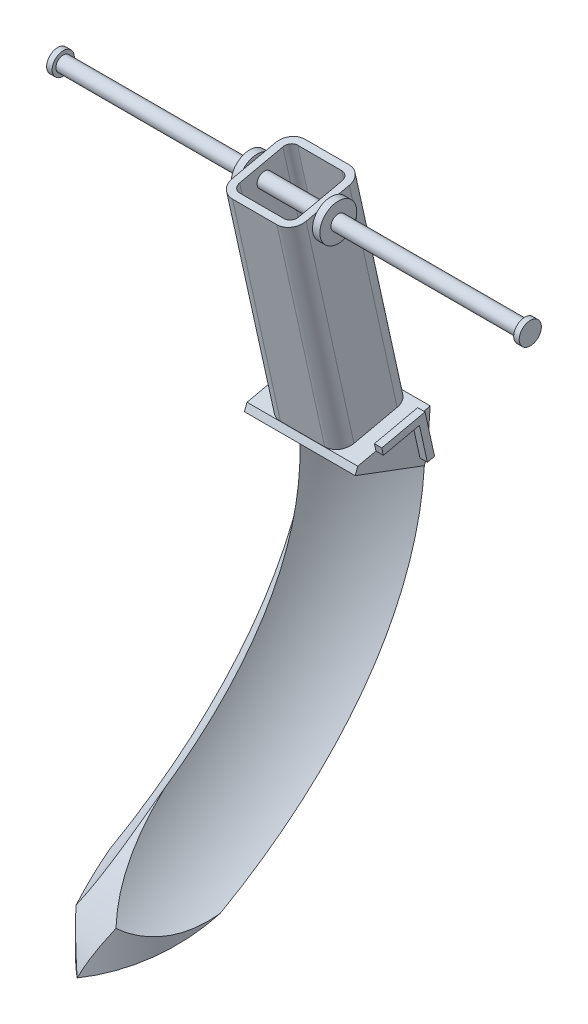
ISO-10303-21;
HEADER;
FILE_DESCRIPTION(('STEP AP214'),'2;1');
FILE_NAME('part.step','',(''),(''),'','','');
FILE_SCHEMA(('AUTOMOTIVE_DESIGN { 1 0 10303 214 1 1 1 1 }'));
ENDSEC;
DATA;
#1=APPLICATION_CONTEXT('core data for automotive mechanical design processes');
#2=APPLICATION_PROTOCOL_DEFINITION('international standard','automotive_design',2000,#1);
#3=PRODUCT_CONTEXT('',#1,'mechanical');
#4=PRODUCT('Part','Part','',(#3));
#5=PRODUCT_RELATED_PRODUCT_CATEGORY('part','',(#4));
#6=PRODUCT_DEFINITION_FORMATION('','',#4);
#7=PRODUCT_DEFINITION_CONTEXT('part definition',#1,'design');
#8=PRODUCT_DEFINITION('design','',#6,#7);
#9=PRODUCT_DEFINITION_SHAPE('','',#8);
#10=(LENGTH_UNIT() NAMED_UNIT(*) SI_UNIT(.MILLI.,.METRE.));
#11=(NAMED_UNIT(*) PLANE_ANGLE_UNIT() SI_UNIT($,.RADIAN.));
#12=(NAMED_UNIT(*) SI_UNIT($,.STERADIAN.) SOLID_ANGLE_UNIT());
#13=UNCERTAINTY_MEASURE_WITH_UNIT(LENGTH_MEASURE(1.E-05),#10,'distance_accuracy_value','');
#14=(GEOMETRIC_REPRESENTATION_CONTEXT(3) GLOBAL_UNCERTAINTY_ASSIGNED_CONTEXT((#13)) GLOBAL_UNIT_ASSIGNED_CONTEXT((#10,
#11,#12)) REPRESENTATION_CONTEXT('',''));
#15=CARTESIAN_POINT('',(0.,0.,0.));
#16=DIRECTION('',(0.,0.,1.));
#17=DIRECTION('',(1.,0.,0.));
#18=AXIS2_PLACEMENT_3D('',#15,#16,#17);
#19=CARTESIAN_POINT('',(17.,46.324854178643,10.2382152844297));
#20=DIRECTION('',(0.,-0.976437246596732,-0.215801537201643));
#21=DIRECTION('',(0.,0.215801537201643,-0.976437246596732));
#22=AXIS2_PLACEMENT_3D('',#19,#20,#21);
#23=PLANE('',#22);
#24=DIRECTION('',(0.,-0.215801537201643,0.976437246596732));
#25=VECTOR('',#24,1.);
#26=CARTESIAN_POINT('',(15.,46.324854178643,10.2382152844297));
#27=LINE('',#26,#25);
#28=CARTESIAN_POINT('',(15.,55.9131411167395,-33.1459080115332));
#29=VERTEX_POINT('',#28);
#30=CARTESIAN_POINT('',(15.,55.4816152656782,-31.193382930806));
#31=VERTEX_POINT('',#30);
#32=EDGE_CURVE('E209',#29,#31,#27,.T.);
#33=ORIENTED_EDGE('',*,*,#32,.F.);
#34=DIRECTION('',(-1.,0.,0.));
#35=VECTOR('',#34,1.);
#36=CARTESIAN_POINT('',(17.,55.9131411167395,-33.1459080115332));
#37=LINE('',#36,#35);
#38=CARTESIAN_POINT('',(17.,55.9131411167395,-33.1459080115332));
#39=VERTEX_POINT('',#38);
#40=EDGE_CURVE('E13',#39,#29,#37,.T.);
#41=ORIENTED_EDGE('',*,*,#40,.F.);
#42=DIRECTION('',(0.,-0.215801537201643,0.976437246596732));
#43=VECTOR('',#42,1.);
#44=CARTESIAN_POINT('',(17.,46.324854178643,10.2382152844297));
#45=LINE('',#44,#43);
#46=CARTESIAN_POINT('',(17.,55.4816152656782,-31.193382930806));
#47=VERTEX_POINT('',#46);
#48=EDGE_CURVE('E226',#39,#47,#45,.T.);
#49=ORIENTED_EDGE('',*,*,#48,.T.);
#50=DIRECTION('',(-1.,0.,0.));
#51=VECTOR('',#50,1.);
#52=CARTESIAN_POINT('',(17.,55.4816152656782,-31.193382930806));
#53=LINE('',#52,#51);
#54=EDGE_CURVE('E168',#47,#31,#53,.T.);
#55=ORIENTED_EDGE('',*,*,#54,.T.);
#56=EDGE_LOOP('',(#33,#41,#49,#55));
#57=FACE_BOUND('',#56,.T.);
#58=ADVANCED_FACE('F121',(#57),#23,.T.);
#59=CARTESIAN_POINT('',(17.,-2.2394083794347,-28.591086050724));
#60=DIRECTION('',(0.,0.0780862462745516,0.996946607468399));
#61=DIRECTION('',(0.,-0.996946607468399,0.0780862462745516));
#62=AXIS2_PLACEMENT_3D('',#59,#60,#61);
#63=PLANE('',#62);
#64=DIRECTION('',(0.,0.996946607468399,-0.0780862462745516));
#65=VECTOR('',#64,1.);
#66=CARTESIAN_POINT('',(15.,-2.2394083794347,-28.591086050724));
#67=LINE('',#66,#65);
#68=CARTESIAN_POINT('',(15.,55.9143654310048,-33.1460039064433));
#69=VERTEX_POINT('',#68);
#70=EDGE_CURVE('E212',#29,#69,#67,.T.);
#71=ORIENTED_EDGE('',*,*,#70,.T.);
#72=DIRECTION('',(-1.,0.,0.));
#73=VECTOR('',#72,1.);
#74=CARTESIAN_POINT('',(17.,55.9143654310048,-33.1460039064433));
#75=LINE('',#74,#73);
#76=CARTESIAN_POINT('',(17.,55.9143654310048,-33.1460039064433));
#77=VERTEX_POINT('',#76);
#78=EDGE_CURVE('E129',#77,#69,#75,.T.);
#79=ORIENTED_EDGE('',*,*,#78,.F.);
#80=DIRECTION('',(0.,0.996946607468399,-0.0780862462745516));
#81=VECTOR('',#80,1.);
#82=CARTESIAN_POINT('',(17.,-2.2394083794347,-28.591086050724));
#83=LINE('',#82,#81);
#84=EDGE_CURVE('E245',#39,#77,#83,.T.);
#85=ORIENTED_EDGE('',*,*,#84,.F.);
#86=ORIENTED_EDGE('',*,*,#40,.T.);
#87=EDGE_LOOP('',(#71,#79,#85,#86));
#88=FACE_BOUND('',#87,.T.);
#89=ADVANCED_FACE('F239',(#88),#63,.F.);
#90=CARTESIAN_POINT('',(17.,9.58836416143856,-43.3844727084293));
#91=DIRECTION('',(0.,0.215801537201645,-0.976437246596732));
#92=DIRECTION('',(0.,0.976437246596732,0.215801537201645));
#93=AXIS2_PLACEMENT_3D('',#90,#91,#92);
#94=PLANE('',#93);
#95=DIRECTION('',(0.,-0.976437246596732,-0.215801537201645));
#96=VECTOR('',#95,1.);
#97=CARTESIAN_POINT('',(15.,9.58836416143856,-43.3844727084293));
#98=LINE('',#97,#96);
#99=CARTESIAN_POINT('',(15.,67.6304652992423,-30.5566389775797));
#100=VERTEX_POINT('',#99);
#101=EDGE_CURVE('E215',#100,#69,#98,.T.);
#102=ORIENTED_EDGE('',*,*,#101,.F.);
#103=DIRECTION('',(-1.,0.,0.));
#104=VECTOR('',#103,1.);
#105=CARTESIAN_POINT('',(17.,67.6304652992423,-30.5566389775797));
#106=LINE('',#105,#104);
#107=CARTESIAN_POINT('',(17.,67.6304652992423,-30.5566389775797));
#108=VERTEX_POINT('',#107);
#109=EDGE_CURVE('E230',#108,#100,#106,.T.);
#110=ORIENTED_EDGE('',*,*,#109,.F.);
#111=DIRECTION('',(0.,-0.976437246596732,-0.215801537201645));
#112=VECTOR('',#111,1.);
#113=CARTESIAN_POINT('',(17.,9.58836416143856,-43.3844727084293));
#114=LINE('',#113,#112);
#115=EDGE_CURVE('E236',#108,#77,#114,.T.);
#116=ORIENTED_EDGE('',*,*,#115,.T.);
#117=ORIENTED_EDGE('',*,*,#78,.T.);
#118=EDGE_LOOP('',(#102,#110,#116,#117));
#119=FACE_BOUND('',#118,.T.);
#120=ADVANCED_FACE('F235',(#119),#94,.T.);
#121=CARTESIAN_POINT('',(17.,58.0421011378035,12.8278337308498));
#122=DIRECTION('',(0.,0.976437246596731,0.21580153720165));
#123=DIRECTION('',(0.,-0.21580153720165,0.976437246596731));
#124=AXIS2_PLACEMENT_3D('',#121,#122,#123);
#125=PLANE('',#124);
#126=DIRECTION('',(0.,0.21580153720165,-0.976437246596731));
#127=VECTOR('',#126,1.);
#128=CARTESIAN_POINT('',(15.,58.0421011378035,12.8278337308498));
#129=LINE('',#128,#127);
#130=CARTESIAN_POINT('',(15.,65.0408468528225,-18.8393920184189));
#131=VERTEX_POINT('',#130);
#132=EDGE_CURVE('E218',#131,#100,#129,.T.);
#133=ORIENTED_EDGE('',*,*,#132,.F.);
#134=DIRECTION('',(-1.,0.,0.));
#135=VECTOR('',#134,1.);
#136=CARTESIAN_POINT('',(17.,65.0408468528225,-18.8393920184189));
#137=LINE('',#136,#135);
#138=CARTESIAN_POINT('',(17.,65.0408468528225,-18.8393920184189));
#139=VERTEX_POINT('',#138);
#140=EDGE_CURVE('E195',#139,#131,#137,.T.);
#141=ORIENTED_EDGE('',*,*,#140,.F.);
#142=DIRECTION('',(0.,0.21580153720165,-0.976437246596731));
#143=VECTOR('',#142,1.);
#144=CARTESIAN_POINT('',(17.,58.0421011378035,12.8278337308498));
#145=LINE('',#144,#143);
#146=EDGE_CURVE('E202',#139,#108,#145,.T.);
#147=ORIENTED_EDGE('',*,*,#146,.T.);
#148=ORIENTED_EDGE('',*,*,#109,.T.);
#149=EDGE_LOOP('',(#133,#141,#147,#148));
#150=FACE_BOUND('',#149,.T.);
#151=ADVANCED_FACE('F244',(#150),#125,.T.);
#152=CARTESIAN_POINT('',(17.,6.99874571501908,-31.6672257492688));
#153=DIRECTION('',(0.,-0.215801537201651,0.976437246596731));
#154=DIRECTION('',(0.,-0.976437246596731,-0.215801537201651));
#155=AXIS2_PLACEMENT_3D('',#152,#153,#154);
#156=PLANE('',#155);
#157=DIRECTION('',(0.,0.976437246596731,0.215801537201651));
#158=VECTOR('',#157,1.);
#159=CARTESIAN_POINT('',(15.,6.99874571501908,-31.6672257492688));
#160=LINE('',#159,#158);
#161=CARTESIAN_POINT('',(15.,63.087972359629,-19.2709950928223));
#162=VERTEX_POINT('',#161);
#163=EDGE_CURVE('E190',#162,#131,#160,.T.);
#164=ORIENTED_EDGE('',*,*,#163,.F.);
#165=DIRECTION('',(-1.,0.,0.));
#166=VECTOR('',#165,1.);
#167=CARTESIAN_POINT('',(17.,63.087972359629,-19.2709950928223));
#168=LINE('',#167,#166);
#169=CARTESIAN_POINT('',(17.,63.087972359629,-19.2709950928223));
#170=VERTEX_POINT('',#169);
#171=EDGE_CURVE('E185',#170,#162,#168,.T.);
#172=ORIENTED_EDGE('',*,*,#171,.F.);
#173=DIRECTION('',(0.,0.976437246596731,0.215801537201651));
#174=VECTOR('',#173,1.);
#175=CARTESIAN_POINT('',(17.,6.99874571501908,-31.6672257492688));
#176=LINE('',#175,#174);
#177=EDGE_CURVE('E188',#170,#139,#176,.T.);
#178=ORIENTED_EDGE('',*,*,#177,.T.);
#179=ORIENTED_EDGE('',*,*,#140,.T.);
#180=EDGE_LOOP('',(#164,#172,#178,#179));
#181=FACE_BOUND('',#180,.T.);
#182=ADVANCED_FACE('F187',(#181),#156,.T.);
#183=CARTESIAN_POINT('',(17.,56.08922664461,12.3962306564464));
#184=DIRECTION('',(0.,-0.976437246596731,-0.215801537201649));
#185=DIRECTION('',(0.,0.215801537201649,-0.976437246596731));
#186=AXIS2_PLACEMENT_3D('',#183,#184,#185);
#187=PLANE('',#186);
#188=DIRECTION('',(0.,-0.215801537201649,0.976437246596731));
#189=VECTOR('',#188,1.);
#190=CARTESIAN_POINT('',(15.,56.08922664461,12.3962306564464));
#191=LINE('',#190,#189);
#192=CARTESIAN_POINT('',(15.,65.2459877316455,-29.0353675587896));
#193=VERTEX_POINT('',#192);
#194=EDGE_CURVE('E222',#193,#162,#191,.T.);
#195=ORIENTED_EDGE('',*,*,#194,.F.);
#196=DIRECTION('',(-1.,0.,0.));
#197=VECTOR('',#196,1.);
#198=CARTESIAN_POINT('',(17.,65.2459877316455,-29.0353675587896));
#199=LINE('',#198,#197);
#200=CARTESIAN_POINT('',(17.,65.2459877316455,-29.0353675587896));
#201=VERTEX_POINT('',#200);
#202=EDGE_CURVE('E161',#201,#193,#199,.T.);
#203=ORIENTED_EDGE('',*,*,#202,.F.);
#204=DIRECTION('',(0.,-0.215801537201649,0.976437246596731));
#205=VECTOR('',#204,1.);
#206=CARTESIAN_POINT('',(17.,56.08922664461,12.3962306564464));
#207=LINE('',#206,#205);
#208=EDGE_CURVE('E199',#201,#170,#207,.T.);
#209=ORIENTED_EDGE('',*,*,#208,.T.);
#210=ORIENTED_EDGE('',*,*,#171,.T.);
#211=EDGE_LOOP('',(#195,#203,#209,#210));
#212=FACE_BOUND('',#211,.T.);
#213=ADVANCED_FACE('F204',(#212),#187,.T.);
#214=CARTESIAN_POINT('',(17.,9.1567610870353,-41.4315982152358));
#215=DIRECTION('',(0.,0.215801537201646,-0.976437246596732));
#216=DIRECTION('',(0.,0.976437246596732,0.215801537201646));
#217=AXIS2_PLACEMENT_3D('',#214,#215,#216);
#218=PLANE('',#217);
#219=DIRECTION('',(0.,-0.976437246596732,-0.215801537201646));
#220=VECTOR('',#219,1.);
#221=CARTESIAN_POINT('',(15.,9.1567610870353,-41.4315982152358));
#222=LINE('',#221,#220);
#223=EDGE_CURVE('E224',#193,#31,#222,.T.);
#224=ORIENTED_EDGE('',*,*,#223,.T.);
#225=ORIENTED_EDGE('',*,*,#54,.F.);
#226=DIRECTION('',(0.,-0.976437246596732,-0.215801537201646));
#227=VECTOR('',#226,1.);
#228=CARTESIAN_POINT('',(17.,9.1567610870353,-41.4315982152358));
#229=LINE('',#228,#227);
#230=EDGE_CURVE('E137',#201,#47,#229,.T.);
#231=ORIENTED_EDGE('',*,*,#230,.F.);
#232=ORIENTED_EDGE('',*,*,#202,.T.);
#233=EDGE_LOOP('',(#224,#225,#231,#232));
#234=FACE_BOUND('',#233,.T.);
#235=ADVANCED_FACE('F264',(#234),#218,.F.);
#236=CARTESIAN_POINT('',(17.,0.,0.));
#237=DIRECTION('',(1.,0.,0.));
#238=DIRECTION('',(0.,0.,-1.));
#239=AXIS2_PLACEMENT_3D('',#236,#237,#238);
#240=PLANE('',#239);
#241=ORIENTED_EDGE('',*,*,#48,.F.);
#242=ORIENTED_EDGE('',*,*,#84,.T.);
#243=ORIENTED_EDGE('',*,*,#115,.F.);
#244=ORIENTED_EDGE('',*,*,#146,.F.);
#245=ORIENTED_EDGE('',*,*,#177,.F.);
#246=ORIENTED_EDGE('',*,*,#208,.F.);
#247=ORIENTED_EDGE('',*,*,#230,.T.);
#248=EDGE_LOOP('',(#241,#242,#243,#244,#245,#246,#247));
#249=FACE_BOUND('',#248,.T.);
#250=ADVANCED_FACE('F198',(#249),#240,.T.);
#251=CARTESIAN_POINT('',(15.,0.,0.));
#252=DIRECTION('',(1.,0.,0.));
#253=DIRECTION('',(0.,0.,-1.));
#254=AXIS2_PLACEMENT_3D('',#251,#252,#253);
#255=PLANE('',#254);
#256=ORIENTED_EDGE('',*,*,#32,.T.);
#257=ORIENTED_EDGE('',*,*,#223,.F.);
#258=ORIENTED_EDGE('',*,*,#194,.T.);
#259=ORIENTED_EDGE('',*,*,#163,.T.);
#260=ORIENTED_EDGE('',*,*,#132,.T.);
#261=ORIENTED_EDGE('',*,*,#101,.T.);
#262=ORIENTED_EDGE('',*,*,#70,.F.);
#263=EDGE_LOOP('',(#256,#257,#258,#259,#260,#261,#262));
#264=FACE_BOUND('',#263,.T.);
#265=ADVANCED_FACE('F241',(#264),#255,.F.);
#266=CLOSED_SHELL('',(#58,#89,#120,#151,#182,#213,#235,#250,#265));
#267=MANIFOLD_SOLID_BREP('B2',#266);
#268=CARTESIAN_POINT('',(6.,121.458405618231,-5.34646561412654));
#269=DIRECTION('',(0.,-0.976437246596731,-0.215801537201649));
#270=DIRECTION('',(0.,0.215801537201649,-0.976437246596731));
#271=AXIS2_PLACEMENT_3D('',#268,#269,#270);
#272=CYLINDRICAL_SURFACE('',#271,4.);
#273=CARTESIAN_POINT('',(6.,62.8721708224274,-18.2945578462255));
#274=DIRECTION('',(0.,0.976437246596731,0.215801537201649));
#275=DIRECTION('',(0.,-0.215801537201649,0.976437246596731));
#276=AXIS2_PLACEMENT_3D('',#273,#274,#275);
#277=CIRCLE('',#276,4.);
#278=CARTESIAN_POINT('',(6.,62.0089646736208,-14.3888088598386));
#279=VERTEX_POINT('',#278);
#280=CARTESIAN_POINT('',(10.,62.8721708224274,-18.2945578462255));
#281=VERTEX_POINT('',#280);
#282=EDGE_CURVE('E664',#279,#281,#277,.T.);
#283=ORIENTED_EDGE('',*,*,#282,.T.);
#284=DIRECTION('',(0.,-0.976437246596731,-0.215801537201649));
#285=VECTOR('',#284,1.);
#286=CARTESIAN_POINT('',(10.,121.458405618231,-5.34646561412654));
#287=LINE('',#286,#285);
#288=CARTESIAN_POINT('',(10.,121.458405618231,-5.34646561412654));
#289=VERTEX_POINT('',#288);
#290=EDGE_CURVE('E697',#289,#281,#287,.T.);
#291=ORIENTED_EDGE('',*,*,#290,.F.);
#292=CARTESIAN_POINT('',(6.,121.458405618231,-5.34646561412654));
#293=DIRECTION('',(0.,0.976437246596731,0.215801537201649));
#294=DIRECTION('',(0.,-0.215801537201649,0.976437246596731));
#295=AXIS2_PLACEMENT_3D('',#292,#293,#294);
#296=CIRCLE('',#295,4.);
#297=CARTESIAN_POINT('',(6.,120.595199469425,-1.44071662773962));
#298=VERTEX_POINT('',#297);
#299=EDGE_CURVE('E502',#298,#289,#296,.T.);
#300=ORIENTED_EDGE('',*,*,#299,.F.);
#301=DIRECTION('',(0.,-0.976437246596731,-0.215801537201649));
#302=VECTOR('',#301,1.);
#303=CARTESIAN_POINT('',(6.,120.595199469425,-1.44071662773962));
#304=LINE('',#303,#302);
#305=EDGE_CURVE('E679',#298,#279,#304,.T.);
#306=ORIENTED_EDGE('',*,*,#305,.T.);
#307=EDGE_LOOP('',(#283,#291,#300,#306));
#308=FACE_BOUND('',#307,.T.);
#309=ADVANCED_FACE('F341',(#308),#272,.T.);
#310=CARTESIAN_POINT('',(10.,121.458405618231,-5.34646561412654));
#311=DIRECTION('',(-1.,0.,0.));
#312=DIRECTION('',(0.,0.,1.));
#313=AXIS2_PLACEMENT_3D('',#310,#311,#312);
#314=PLANE('',#313);
#315=CARTESIAN_POINT('',(10.,118.847465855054,-12.0682952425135));
#316=DIRECTION('',(1.,0.,0.));
#317=DIRECTION('',(0.,0.,-1.));
#318=AXIS2_PLACEMENT_3D('',#315,#316,#317);
#319=CIRCLE('',#318,5.);
#320=CARTESIAN_POINT('',(10.,122.105810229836,-8.27577735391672));
#321=VERTEX_POINT('',#320);
#322=CARTESIAN_POINT('',(10.,123.400619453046,-14.1344008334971));
#323=VERTEX_POINT('',#322);
#324=EDGE_CURVE('E550',#321,#323,#319,.T.);
#325=ORIENTED_EDGE('',*,*,#324,.F.);
#326=DIRECTION('',(0.,0.21580153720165,-0.976437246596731));
#327=VECTOR('',#326,1.);
#328=CARTESIAN_POINT('',(10.,121.458405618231,-5.34646561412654));
#329=LINE('',#328,#327);
#330=EDGE_CURVE('E497',#289,#321,#329,.T.);
#331=ORIENTED_EDGE('',*,*,#330,.F.);
#332=ORIENTED_EDGE('',*,*,#290,.T.);
#333=DIRECTION('',(0.,0.21580153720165,-0.976437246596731));
#334=VECTOR('',#333,1.);
#335=CARTESIAN_POINT('',(10.,62.8721708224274,-18.2945578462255));
#336=LINE('',#335,#334);
#337=CARTESIAN_POINT('',(10.,65.4617892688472,-30.0118048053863));
#338=VERTEX_POINT('',#337);
#339=EDGE_CURVE('E666',#281,#338,#336,.T.);
#340=ORIENTED_EDGE('',*,*,#339,.T.);
#341=DIRECTION('',(0.,-0.976437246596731,-0.215801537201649));
#342=VECTOR('',#341,1.);
#343=CARTESIAN_POINT('',(10.,124.048024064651,-17.0637125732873));
#344=LINE('',#343,#342);
#345=CARTESIAN_POINT('',(10.,124.048024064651,-17.0637125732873));
#346=VERTEX_POINT('',#345);
#347=EDGE_CURVE('E565',#346,#338,#344,.T.);
#348=ORIENTED_EDGE('',*,*,#347,.F.);
#349=EDGE_CURVE('E501',#323,#346,#329,.T.);
#350=ORIENTED_EDGE('',*,*,#349,.F.);
#351=EDGE_LOOP('',(#325,#331,#332,#340,#348,#350));
#352=FACE_BOUND('',#351,.T.);
#353=ADVANCED_FACE('F563',(#352),#314,.F.);
#354=CARTESIAN_POINT('',(6.,124.048024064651,-17.0637125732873));
#355=DIRECTION('',(0.,-0.976437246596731,-0.215801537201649));
#356=DIRECTION('',(0.,0.215801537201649,-0.976437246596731));
#357=AXIS2_PLACEMENT_3D('',#354,#355,#356);
#358=CYLINDRICAL_SURFACE('',#357,4.);
#359=CARTESIAN_POINT('',(6.,65.4617892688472,-30.0118048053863));
#360=DIRECTION('',(0.,0.976437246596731,0.215801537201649));
#361=DIRECTION('',(0.,-0.215801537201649,0.976437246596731));
#362=AXIS2_PLACEMENT_3D('',#359,#360,#361);
#363=CIRCLE('',#362,4.);
#364=CARTESIAN_POINT('',(6.,66.3249954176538,-33.9175537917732));
#365=VERTEX_POINT('',#364);
#366=EDGE_CURVE('E668',#338,#365,#363,.T.);
#367=ORIENTED_EDGE('',*,*,#366,.T.);
#368=DIRECTION('',(0.,-0.976437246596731,-0.215801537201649));
#369=VECTOR('',#368,1.);
#370=CARTESIAN_POINT('',(6.,124.911230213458,-20.9694615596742));
#371=LINE('',#370,#369);
#372=CARTESIAN_POINT('',(6.,124.911230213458,-20.9694615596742));
#373=VERTEX_POINT('',#372);
#374=EDGE_CURVE('E693',#373,#365,#371,.T.);
#375=ORIENTED_EDGE('',*,*,#374,.F.);
#376=CARTESIAN_POINT('',(6.,124.048024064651,-17.0637125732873));
#377=DIRECTION('',(0.,0.976437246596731,0.215801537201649));
#378=DIRECTION('',(0.,-0.215801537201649,0.976437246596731));
#379=AXIS2_PLACEMENT_3D('',#376,#377,#378);
#380=CIRCLE('',#379,4.);
#381=EDGE_CURVE('E493',#346,#373,#380,.T.);
#382=ORIENTED_EDGE('',*,*,#381,.F.);
#383=ORIENTED_EDGE('',*,*,#347,.T.);
#384=EDGE_LOOP('',(#367,#375,#382,#383));
#385=FACE_BOUND('',#384,.T.);
#386=ADVANCED_FACE('F590',(#385),#358,.T.);
#387=CARTESIAN_POINT('',(-6.,124.911230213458,-20.9694615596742));
#388=DIRECTION('',(0.,-0.215801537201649,0.976437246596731));
#389=DIRECTION('',(0.,-0.976437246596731,-0.215801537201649));
#390=AXIS2_PLACEMENT_3D('',#387,#388,#389);
#391=PLANE('',#390);
#392=DIRECTION('',(-1.,0.,0.));
#393=VECTOR('',#392,1.);
#394=CARTESIAN_POINT('',(-6.,66.3249954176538,-33.9175537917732));
#395=LINE('',#394,#393);
#396=CARTESIAN_POINT('',(-6.,66.3249954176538,-33.9175537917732));
#397=VERTEX_POINT('',#396);
#398=EDGE_CURVE('E670',#365,#397,#395,.T.);
#399=ORIENTED_EDGE('',*,*,#398,.T.);
#400=DIRECTION('',(0.,-0.976437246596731,-0.215801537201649));
#401=VECTOR('',#400,1.);
#402=CARTESIAN_POINT('',(-6.,124.911230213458,-20.9694615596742));
#403=LINE('',#402,#401);
#404=CARTESIAN_POINT('',(-6.,124.911230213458,-20.9694615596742));
#405=VERTEX_POINT('',#404);
#406=EDGE_CURVE('E690',#405,#397,#403,.T.);
#407=ORIENTED_EDGE('',*,*,#406,.F.);
#408=DIRECTION('',(-1.,0.,0.));
#409=VECTOR('',#408,1.);
#410=CARTESIAN_POINT('',(-6.,124.911230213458,-20.9694615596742));
#411=LINE('',#410,#409);
#412=EDGE_CURVE('E492',#373,#405,#411,.T.);
#413=ORIENTED_EDGE('',*,*,#412,.F.);
#414=ORIENTED_EDGE('',*,*,#374,.T.);
#415=EDGE_LOOP('',(#399,#407,#413,#414));
#416=FACE_BOUND('',#415,.T.);
#417=ADVANCED_FACE('F772',(#416),#391,.F.);
#418=CARTESIAN_POINT('',(-6.,124.048024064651,-17.0637125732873));
#419=DIRECTION('',(0.,-0.976437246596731,-0.215801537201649));
#420=DIRECTION('',(0.,0.215801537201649,-0.976437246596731));
#421=AXIS2_PLACEMENT_3D('',#418,#419,#420);
#422=CYLINDRICAL_SURFACE('',#421,4.);
#423=CARTESIAN_POINT('',(-6.,65.4617892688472,-30.0118048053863));
#424=DIRECTION('',(0.,0.976437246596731,0.215801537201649));
#425=DIRECTION('',(0.,-0.215801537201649,0.976437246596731));
#426=AXIS2_PLACEMENT_3D('',#423,#424,#425);
#427=CIRCLE('',#426,4.);
#428=CARTESIAN_POINT('',(-10.,65.4617892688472,-30.0118048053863));
#429=VERTEX_POINT('',#428);
#430=EDGE_CURVE('E672',#397,#429,#427,.T.);
#431=ORIENTED_EDGE('',*,*,#430,.T.);
#432=DIRECTION('',(0.,-0.976437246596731,-0.215801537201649));
#433=VECTOR('',#432,1.);
#434=CARTESIAN_POINT('',(-10.,124.048024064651,-17.0637125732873));
#435=LINE('',#434,#433);
#436=CARTESIAN_POINT('',(-10.,124.048024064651,-17.0637125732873));
#437=VERTEX_POINT('',#436);
#438=EDGE_CURVE('E688',#437,#429,#435,.T.);
#439=ORIENTED_EDGE('',*,*,#438,.F.);
#440=CARTESIAN_POINT('',(-6.,124.048024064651,-17.0637125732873));
#441=DIRECTION('',(0.,0.976437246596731,0.215801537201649));
#442=DIRECTION('',(0.,-0.215801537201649,0.976437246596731));
#443=AXIS2_PLACEMENT_3D('',#440,#441,#442);
#444=CIRCLE('',#443,4.);
#445=EDGE_CURVE('E486',#405,#437,#444,.T.);
#446=ORIENTED_EDGE('',*,*,#445,.F.);
#447=ORIENTED_EDGE('',*,*,#406,.T.);
#448=EDGE_LOOP('',(#431,#439,#446,#447));
#449=FACE_BOUND('',#448,.T.);
#450=ADVANCED_FACE('F769',(#449),#422,.T.);
#451=CARTESIAN_POINT('',(-10.,124.048024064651,-17.0637125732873));
#452=DIRECTION('',(1.,0.,0.));
#453=DIRECTION('',(0.,0.,-1.));
#454=AXIS2_PLACEMENT_3D('',#451,#452,#453);
#455=PLANE('',#454);
#456=CARTESIAN_POINT('',(-10.,118.847465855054,-12.0682952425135));
#457=DIRECTION('',(-1.,0.,0.));
#458=DIRECTION('',(0.,0.,1.));
#459=AXIS2_PLACEMENT_3D('',#456,#457,#458);
#460=CIRCLE('',#459,5.);
#461=CARTESIAN_POINT('',(-10.,123.400619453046,-14.1344008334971));
#462=VERTEX_POINT('',#461);
#463=CARTESIAN_POINT('',(-10.,122.105810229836,-8.27577735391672));
#464=VERTEX_POINT('',#463);
#465=EDGE_CURVE('E474',#462,#464,#460,.T.);
#466=ORIENTED_EDGE('',*,*,#465,.F.);
#467=DIRECTION('',(0.,-0.21580153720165,0.976437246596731));
#468=VECTOR('',#467,1.);
#469=CARTESIAN_POINT('',(-10.,124.048024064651,-17.0637125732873));
#470=LINE('',#469,#468);
#471=EDGE_CURVE('E468',#437,#462,#470,.T.);
#472=ORIENTED_EDGE('',*,*,#471,.F.);
#473=ORIENTED_EDGE('',*,*,#438,.T.);
#474=DIRECTION('',(0.,-0.21580153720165,0.976437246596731));
#475=VECTOR('',#474,1.);
#476=CARTESIAN_POINT('',(-10.,65.4617892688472,-30.0118048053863));
#477=LINE('',#476,#475);
#478=CARTESIAN_POINT('',(-10.,62.8721708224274,-18.2945578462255));
#479=VERTEX_POINT('',#478);
#480=EDGE_CURVE('E674',#429,#479,#477,.T.);
#481=ORIENTED_EDGE('',*,*,#480,.T.);
#482=DIRECTION('',(0.,-0.976437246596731,-0.215801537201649));
#483=VECTOR('',#482,1.);
#484=CARTESIAN_POINT('',(-10.,121.458405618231,-5.34646561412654));
#485=LINE('',#484,#483);
#486=CARTESIAN_POINT('',(-10.,121.458405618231,-5.34646561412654));
#487=VERTEX_POINT('',#486);
#488=EDGE_CURVE('E685',#487,#479,#485,.T.);
#489=ORIENTED_EDGE('',*,*,#488,.F.);
#490=EDGE_CURVE('E469',#464,#487,#470,.T.);
#491=ORIENTED_EDGE('',*,*,#490,.F.);
#492=EDGE_LOOP('',(#466,#472,#473,#481,#489,#491));
#493=FACE_BOUND('',#492,.T.);
#494=ADVANCED_FACE('F480',(#493),#455,.F.);
#495=CARTESIAN_POINT('',(-6.,121.458405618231,-5.34646561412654));
#496=DIRECTION('',(0.,-0.976437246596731,-0.215801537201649));
#497=DIRECTION('',(0.,0.215801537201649,-0.976437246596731));
#498=AXIS2_PLACEMENT_3D('',#495,#496,#497);
#499=CYLINDRICAL_SURFACE('',#498,4.);
#500=CARTESIAN_POINT('',(-6.,62.8721708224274,-18.2945578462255));
#501=DIRECTION('',(0.,0.976437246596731,0.215801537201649));
#502=DIRECTION('',(0.,-0.215801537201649,0.976437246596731));
#503=AXIS2_PLACEMENT_3D('',#500,#501,#502);
#504=CIRCLE('',#503,4.);
#505=CARTESIAN_POINT('',(-6.,62.0089646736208,-14.3888088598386));
#506=VERTEX_POINT('',#505);
#507=EDGE_CURVE('E676',#479,#506,#504,.T.);
#508=ORIENTED_EDGE('',*,*,#507,.T.);
#509=DIRECTION('',(0.,-0.976437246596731,-0.215801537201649));
#510=VECTOR('',#509,1.);
#511=CARTESIAN_POINT('',(-6.,120.595199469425,-1.44071662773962));
#512=LINE('',#511,#510);
#513=CARTESIAN_POINT('',(-6.,120.595199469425,-1.44071662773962));
#514=VERTEX_POINT('',#513);
#515=EDGE_CURVE('E682',#514,#506,#512,.T.);
#516=ORIENTED_EDGE('',*,*,#515,.F.);
#517=CARTESIAN_POINT('',(-6.,121.458405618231,-5.34646561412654));
#518=DIRECTION('',(0.,0.976437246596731,0.215801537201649));
#519=DIRECTION('',(0.,-0.215801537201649,0.976437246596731));
#520=AXIS2_PLACEMENT_3D('',#517,#518,#519);
#521=CIRCLE('',#520,4.);
#522=EDGE_CURVE('E488',#487,#514,#521,.T.);
#523=ORIENTED_EDGE('',*,*,#522,.F.);
#524=ORIENTED_EDGE('',*,*,#488,.T.);
#525=EDGE_LOOP('',(#508,#516,#523,#524));
#526=FACE_BOUND('',#525,.T.);
#527=ADVANCED_FACE('F626',(#526),#499,.T.);
#528=CARTESIAN_POINT('',(6.,124.048024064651,-17.0637125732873));
#529=DIRECTION('',(0.,-0.976437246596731,-0.215801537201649));
#530=DIRECTION('',(0.,0.215801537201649,-0.976437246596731));
#531=AXIS2_PLACEMENT_3D('',#528,#529,#530);
#532=CYLINDRICAL_SURFACE('',#531,2.);
#533=CARTESIAN_POINT('',(6.,65.4617892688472,-30.0118048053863));
#534=DIRECTION('',(0.,0.976437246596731,0.215801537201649));
#535=DIRECTION('',(0.,-0.215801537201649,0.976437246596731));
#536=AXIS2_PLACEMENT_3D('',#533,#534,#535);
#537=CIRCLE('',#536,2.);
#538=CARTESIAN_POINT('',(8.,65.4617892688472,-30.0118048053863));
#539=VERTEX_POINT('',#538);
#540=CARTESIAN_POINT('',(6.,65.8933923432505,-31.9646792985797));
#541=VERTEX_POINT('',#540);
#542=EDGE_CURVE('E532',#539,#541,#537,.T.);
#543=ORIENTED_EDGE('',*,*,#542,.F.);
#544=DIRECTION('',(0.,-0.976437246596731,-0.215801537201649));
#545=VECTOR('',#544,1.);
#546=CARTESIAN_POINT('',(8.,124.048024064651,-17.0637125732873));
#547=LINE('',#546,#545);
#548=CARTESIAN_POINT('',(8.,124.048024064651,-17.0637125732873));
#549=VERTEX_POINT('',#548);
#550=EDGE_CURVE('E636',#549,#539,#547,.T.);
#551=ORIENTED_EDGE('',*,*,#550,.F.);
#552=CARTESIAN_POINT('',(6.,124.048024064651,-17.0637125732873));
#553=DIRECTION('',(0.,0.976437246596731,0.215801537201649));
#554=DIRECTION('',(0.,-0.215801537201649,0.976437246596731));
#555=AXIS2_PLACEMENT_3D('',#552,#553,#554);
#556=CIRCLE('',#555,2.);
#557=CARTESIAN_POINT('',(6.,124.479627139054,-19.0165870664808));
#558=VERTEX_POINT('',#557);
#559=EDGE_CURVE('E525',#549,#558,#556,.T.);
#560=ORIENTED_EDGE('',*,*,#559,.T.);
#561=DIRECTION('',(0.,-0.976437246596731,-0.215801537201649));
#562=VECTOR('',#561,1.);
#563=CARTESIAN_POINT('',(6.,124.479627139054,-19.0165870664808));
#564=LINE('',#563,#562);
#565=EDGE_CURVE('E700',#558,#541,#564,.T.);
#566=ORIENTED_EDGE('',*,*,#565,.T.);
#567=EDGE_LOOP('',(#543,#551,#560,#566));
#568=FACE_BOUND('',#567,.T.);
#569=ADVANCED_FACE('F343',(#568),#532,.F.);
#570=CARTESIAN_POINT('',(8.,121.458405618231,-5.34646561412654));
#571=DIRECTION('',(-1.,0.,0.));
#572=DIRECTION('',(0.,0.,1.));
#573=AXIS2_PLACEMENT_3D('',#570,#571,#572);
#574=PLANE('',#573);
#575=CARTESIAN_POINT('',(8.,118.847465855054,-12.0682952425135));
#576=DIRECTION('',(-1.,0.,0.));
#577=DIRECTION('',(0.,0.,1.));
#578=AXIS2_PLACEMENT_3D('',#575,#576,#577);
#579=CIRCLE('',#578,2.);
#580=CARTESIAN_POINT('',(8.,118.847465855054,-10.0682952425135));
#581=VERTEX_POINT('',#580);
#582=EDGE_CURVE('E529',#581,#581,#579,.T.);
#583=ORIENTED_EDGE('',*,*,#582,.F.);
#584=EDGE_LOOP('',(#583));
#585=FACE_BOUND('',#584,.T.);
#586=DIRECTION('',(0.,0.21580153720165,-0.976437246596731));
#587=VECTOR('',#586,1.);
#588=CARTESIAN_POINT('',(8.,62.8721708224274,-18.2945578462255));
#589=LINE('',#588,#587);
#590=CARTESIAN_POINT('',(8.,62.8721708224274,-18.2945578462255));
#591=VERTEX_POINT('',#590);
#592=EDGE_CURVE('E632',#591,#539,#589,.T.);
#593=ORIENTED_EDGE('',*,*,#592,.F.);
#594=DIRECTION('',(0.,-0.976437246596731,-0.215801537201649));
#595=VECTOR('',#594,1.);
#596=CARTESIAN_POINT('',(8.,121.458405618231,-5.34646561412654));
#597=LINE('',#596,#595);
#598=CARTESIAN_POINT('',(8.,121.458405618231,-5.34646561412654));
#599=VERTEX_POINT('',#598);
#600=EDGE_CURVE('E634',#599,#591,#597,.T.);
#601=ORIENTED_EDGE('',*,*,#600,.F.);
#602=DIRECTION('',(0.,0.21580153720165,-0.976437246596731));
#603=VECTOR('',#602,1.);
#604=CARTESIAN_POINT('',(8.,121.458405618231,-5.34646561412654));
#605=LINE('',#604,#603);
#606=EDGE_CURVE('E522',#599,#549,#605,.T.);
#607=ORIENTED_EDGE('',*,*,#606,.T.);
#608=ORIENTED_EDGE('',*,*,#550,.T.);
#609=EDGE_LOOP('',(#593,#601,#607,#608));
#610=FACE_BOUND('',#609,.T.);
#611=ADVANCED_FACE('F618',(#585,#610),#574,.T.);
#612=CARTESIAN_POINT('',(6.,121.458405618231,-5.34646561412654));
#613=DIRECTION('',(0.,-0.976437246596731,-0.215801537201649));
#614=DIRECTION('',(0.,0.215801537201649,-0.976437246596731));
#615=AXIS2_PLACEMENT_3D('',#612,#613,#614);
#616=CYLINDRICAL_SURFACE('',#615,2.);
#617=CARTESIAN_POINT('',(6.,62.8721708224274,-18.2945578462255));
#618=DIRECTION('',(0.,0.976437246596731,0.215801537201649));
#619=DIRECTION('',(0.,-0.215801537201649,0.976437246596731));
#620=AXIS2_PLACEMENT_3D('',#617,#618,#619);
#621=CIRCLE('',#620,2.);
#622=CARTESIAN_POINT('',(6.,62.4405677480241,-16.3416833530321));
#623=VERTEX_POINT('',#622);
#624=EDGE_CURVE('E640',#623,#591,#621,.T.);
#625=ORIENTED_EDGE('',*,*,#624,.F.);
#626=DIRECTION('',(0.,-0.976437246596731,-0.215801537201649));
#627=VECTOR('',#626,1.);
#628=CARTESIAN_POINT('',(6.,121.026802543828,-3.39359112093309));
#629=LINE('',#628,#627);
#630=CARTESIAN_POINT('',(6.,121.026802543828,-3.39359112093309));
#631=VERTEX_POINT('',#630);
#632=EDGE_CURVE('E710',#631,#623,#629,.T.);
#633=ORIENTED_EDGE('',*,*,#632,.F.);
#634=CARTESIAN_POINT('',(6.,121.458405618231,-5.34646561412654));
#635=DIRECTION('',(0.,0.976437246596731,0.215801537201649));
#636=DIRECTION('',(0.,-0.215801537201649,0.976437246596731));
#637=AXIS2_PLACEMENT_3D('',#634,#635,#636);
#638=CIRCLE('',#637,2.);
#639=EDGE_CURVE('E519',#631,#599,#638,.T.);
#640=ORIENTED_EDGE('',*,*,#639,.T.);
#641=ORIENTED_EDGE('',*,*,#600,.T.);
#642=EDGE_LOOP('',(#625,#633,#640,#641));
#643=FACE_BOUND('',#642,.T.);
#644=ADVANCED_FACE('F615',(#643),#616,.F.);
#645=CARTESIAN_POINT('',(6.,121.026802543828,-3.39359112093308));
#646=DIRECTION('',(0.,0.215801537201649,-0.976437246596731));
#647=DIRECTION('',(0.,0.976437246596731,0.215801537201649));
#648=AXIS2_PLACEMENT_3D('',#645,#646,#647);
#649=PLANE('',#648);
#650=DIRECTION('',(1.,0.,0.));
#651=VECTOR('',#650,1.);
#652=CARTESIAN_POINT('',(6.,62.4405677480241,-16.341683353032));
#653=LINE('',#652,#651);
#654=CARTESIAN_POINT('',(-6.,62.4405677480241,-16.341683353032));
#655=VERTEX_POINT('',#654);
#656=EDGE_CURVE('E648',#655,#623,#653,.T.);
#657=ORIENTED_EDGE('',*,*,#656,.F.);
#658=DIRECTION('',(0.,-0.976437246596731,-0.215801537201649));
#659=VECTOR('',#658,1.);
#660=CARTESIAN_POINT('',(-6.,121.026802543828,-3.39359112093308));
#661=LINE('',#660,#659);
#662=CARTESIAN_POINT('',(-6.,121.026802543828,-3.39359112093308));
#663=VERTEX_POINT('',#662);
#664=EDGE_CURVE('E708',#663,#655,#661,.T.);
#665=ORIENTED_EDGE('',*,*,#664,.F.);
#666=DIRECTION('',(1.,0.,0.));
#667=VECTOR('',#666,1.);
#668=CARTESIAN_POINT('',(6.,121.026802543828,-3.39359112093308));
#669=LINE('',#668,#667);
#670=EDGE_CURVE('E516',#663,#631,#669,.T.);
#671=ORIENTED_EDGE('',*,*,#670,.T.);
#672=ORIENTED_EDGE('',*,*,#632,.T.);
#673=EDGE_LOOP('',(#657,#665,#671,#672));
#674=FACE_BOUND('',#673,.T.);
#675=ADVANCED_FACE('F611',(#674),#649,.T.);
#676=CARTESIAN_POINT('',(-6.,121.458405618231,-5.34646561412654));
#677=DIRECTION('',(0.,-0.976437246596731,-0.215801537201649));
#678=DIRECTION('',(0.,0.215801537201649,-0.976437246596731));
#679=AXIS2_PLACEMENT_3D('',#676,#677,#678);
#680=CYLINDRICAL_SURFACE('',#679,2.);
#681=CARTESIAN_POINT('',(-6.,62.8721708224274,-18.2945578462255));
#682=DIRECTION('',(0.,0.976437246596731,0.215801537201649));
#683=DIRECTION('',(0.,-0.215801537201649,0.976437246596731));
#684=AXIS2_PLACEMENT_3D('',#681,#682,#683);
#685=CIRCLE('',#684,2.);
#686=CARTESIAN_POINT('',(-8.,62.8721708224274,-18.2945578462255));
#687=VERTEX_POINT('',#686);
#688=EDGE_CURVE('E650',#687,#655,#685,.T.);
#689=ORIENTED_EDGE('',*,*,#688,.F.);
#690=DIRECTION('',(0.,-0.976437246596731,-0.215801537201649));
#691=VECTOR('',#690,1.);
#692=CARTESIAN_POINT('',(-8.,121.458405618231,-5.34646561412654));
#693=LINE('',#692,#691);
#694=CARTESIAN_POINT('',(-8.,121.458405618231,-5.34646561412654));
#695=VERTEX_POINT('',#694);
#696=EDGE_CURVE('E706',#695,#687,#693,.T.);
#697=ORIENTED_EDGE('',*,*,#696,.F.);
#698=CARTESIAN_POINT('',(-6.,121.458405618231,-5.34646561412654));
#699=DIRECTION('',(0.,0.976437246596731,0.215801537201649));
#700=DIRECTION('',(0.,-0.215801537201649,0.976437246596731));
#701=AXIS2_PLACEMENT_3D('',#698,#699,#700);
#702=CIRCLE('',#701,2.);
#703=EDGE_CURVE('E513',#695,#663,#702,.T.);
#704=ORIENTED_EDGE('',*,*,#703,.T.);
#705=ORIENTED_EDGE('',*,*,#664,.T.);
#706=EDGE_LOOP('',(#689,#697,#704,#705));
#707=FACE_BOUND('',#706,.T.);
#708=ADVANCED_FACE('F607',(#707),#680,.F.);
#709=CARTESIAN_POINT('',(-8.,124.048024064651,-17.0637125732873));
#710=DIRECTION('',(1.,0.,0.));
#711=DIRECTION('',(0.,0.,-1.));
#712=AXIS2_PLACEMENT_3D('',#709,#710,#711);
#713=PLANE('',#712);
#714=CARTESIAN_POINT('',(-8.,118.847465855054,-12.0682952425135));
#715=DIRECTION('',(1.,0.,0.));
#716=DIRECTION('',(0.,0.,-1.));
#717=AXIS2_PLACEMENT_3D('',#714,#715,#716);
#718=CIRCLE('',#717,2.);
#719=CARTESIAN_POINT('',(-8.,118.847465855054,-14.0682952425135));
#720=VERTEX_POINT('',#719);
#721=EDGE_CURVE('E533',#720,#720,#718,.T.);
#722=ORIENTED_EDGE('',*,*,#721,.F.);
#723=EDGE_LOOP('',(#722));
#724=FACE_BOUND('',#723,.T.);
#725=DIRECTION('',(0.,-0.21580153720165,0.976437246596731));
#726=VECTOR('',#725,1.);
#727=CARTESIAN_POINT('',(-8.,65.4617892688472,-30.0118048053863));
#728=LINE('',#727,#726);
#729=CARTESIAN_POINT('',(-8.,65.4617892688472,-30.0118048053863));
#730=VERTEX_POINT('',#729);
#731=EDGE_CURVE('E655',#730,#687,#728,.T.);
#732=ORIENTED_EDGE('',*,*,#731,.F.);
#733=DIRECTION('',(0.,-0.976437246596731,-0.215801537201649));
#734=VECTOR('',#733,1.);
#735=CARTESIAN_POINT('',(-8.,124.048024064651,-17.0637125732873));
#736=LINE('',#735,#734);
#737=CARTESIAN_POINT('',(-8.,124.048024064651,-17.0637125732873));
#738=VERTEX_POINT('',#737);
#739=EDGE_CURVE('E704',#738,#730,#736,.T.);
#740=ORIENTED_EDGE('',*,*,#739,.F.);
#741=DIRECTION('',(0.,-0.21580153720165,0.976437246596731));
#742=VECTOR('',#741,1.);
#743=CARTESIAN_POINT('',(-8.,124.048024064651,-17.0637125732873));
#744=LINE('',#743,#742);
#745=EDGE_CURVE('E510',#738,#695,#744,.T.);
#746=ORIENTED_EDGE('',*,*,#745,.T.);
#747=ORIENTED_EDGE('',*,*,#696,.T.);
#748=EDGE_LOOP('',(#732,#740,#746,#747));
#749=FACE_BOUND('',#748,.T.);
#750=ADVANCED_FACE('F603',(#724,#749),#713,.T.);
#751=CARTESIAN_POINT('',(-6.,124.048024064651,-17.0637125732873));
#752=DIRECTION('',(0.,-0.976437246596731,-0.215801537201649));
#753=DIRECTION('',(0.,0.215801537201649,-0.976437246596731));
#754=AXIS2_PLACEMENT_3D('',#751,#752,#753);
#755=CYLINDRICAL_SURFACE('',#754,2.);
#756=CARTESIAN_POINT('',(-6.,65.4617892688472,-30.0118048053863));
#757=DIRECTION('',(0.,0.976437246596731,0.215801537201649));
#758=DIRECTION('',(0.,-0.215801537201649,0.976437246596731));
#759=AXIS2_PLACEMENT_3D('',#756,#757,#758);
#760=CIRCLE('',#759,2.);
#761=CARTESIAN_POINT('',(-6.,65.8933923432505,-31.9646792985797));
#762=VERTEX_POINT('',#761);
#763=EDGE_CURVE('E658',#762,#730,#760,.T.);
#764=ORIENTED_EDGE('',*,*,#763,.F.);
#765=DIRECTION('',(0.,-0.976437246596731,-0.215801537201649));
#766=VECTOR('',#765,1.);
#767=CARTESIAN_POINT('',(-6.,124.479627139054,-19.0165870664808));
#768=LINE('',#767,#766);
#769=CARTESIAN_POINT('',(-6.,124.479627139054,-19.0165870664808));
#770=VERTEX_POINT('',#769);
#771=EDGE_CURVE('E702',#770,#762,#768,.T.);
#772=ORIENTED_EDGE('',*,*,#771,.F.);
#773=CARTESIAN_POINT('',(-6.,124.048024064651,-17.0637125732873));
#774=DIRECTION('',(0.,0.976437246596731,0.215801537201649));
#775=DIRECTION('',(0.,-0.215801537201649,0.976437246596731));
#776=AXIS2_PLACEMENT_3D('',#773,#774,#775);
#777=CIRCLE('',#776,2.);
#778=EDGE_CURVE('E507',#770,#738,#777,.T.);
#779=ORIENTED_EDGE('',*,*,#778,.T.);
#780=ORIENTED_EDGE('',*,*,#739,.T.);
#781=EDGE_LOOP('',(#764,#772,#779,#780));
#782=FACE_BOUND('',#781,.T.);
#783=ADVANCED_FACE('F599',(#782),#755,.F.);
#784=CARTESIAN_POINT('',(-6.,124.479627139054,-19.0165870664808));
#785=DIRECTION('',(0.,-0.215801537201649,0.976437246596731));
#786=DIRECTION('',(0.,-0.976437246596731,-0.215801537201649));
#787=AXIS2_PLACEMENT_3D('',#784,#785,#786);
#788=PLANE('',#787);
#789=DIRECTION('',(-1.,0.,0.));
#790=VECTOR('',#789,1.);
#791=CARTESIAN_POINT('',(-6.,65.8933923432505,-31.9646792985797));
#792=LINE('',#791,#790);
#793=EDGE_CURVE('E661',#541,#762,#792,.T.);
#794=ORIENTED_EDGE('',*,*,#793,.F.);
#795=ORIENTED_EDGE('',*,*,#565,.F.);
#796=DIRECTION('',(-1.,0.,0.));
#797=VECTOR('',#796,1.);
#798=CARTESIAN_POINT('',(-6.,124.479627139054,-19.0165870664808));
#799=LINE('',#798,#797);
#800=EDGE_CURVE('E504',#558,#770,#799,.T.);
#801=ORIENTED_EDGE('',*,*,#800,.T.);
#802=ORIENTED_EDGE('',*,*,#771,.T.);
#803=EDGE_LOOP('',(#794,#795,#801,#802));
#804=FACE_BOUND('',#803,.T.);
#805=ADVANCED_FACE('F595',(#804),#788,.T.);
#806=CARTESIAN_POINT('',(6.,120.595199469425,-1.44071662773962));
#807=DIRECTION('',(0.,0.215801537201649,-0.976437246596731));
#808=DIRECTION('',(0.,0.976437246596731,0.215801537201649));
#809=AXIS2_PLACEMENT_3D('',#806,#807,#808);
#810=PLANE('',#809);
#811=DIRECTION('',(1.,0.,0.));
#812=VECTOR('',#811,1.);
#813=CARTESIAN_POINT('',(6.,62.0089646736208,-14.3888088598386));
#814=LINE('',#813,#812);
#815=EDGE_CURVE('E528',#506,#279,#814,.T.);
#816=ORIENTED_EDGE('',*,*,#815,.T.);
#817=ORIENTED_EDGE('',*,*,#305,.F.);
#818=DIRECTION('',(1.,0.,0.));
#819=VECTOR('',#818,1.);
#820=CARTESIAN_POINT('',(6.,120.595199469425,-1.44071662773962));
#821=LINE('',#820,#819);
#822=EDGE_CURVE('E489',#514,#298,#821,.T.);
#823=ORIENTED_EDGE('',*,*,#822,.F.);
#824=ORIENTED_EDGE('',*,*,#515,.T.);
#825=EDGE_LOOP('',(#816,#817,#823,#824));
#826=FACE_BOUND('',#825,.T.);
#827=ADVANCED_FACE('F598',(#826),#810,.F.);
#828=CARTESIAN_POINT('',(6.,121.458405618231,-5.34646561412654));
#829=DIRECTION('',(0.,0.976437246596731,0.215801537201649));
#830=DIRECTION('',(0.,-0.215801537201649,0.976437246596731));
#831=AXIS2_PLACEMENT_3D('',#828,#829,#830);
#832=PLANE('',#831);
#833=ORIENTED_EDGE('',*,*,#559,.F.);
#834=ORIENTED_EDGE('',*,*,#606,.F.);
#835=ORIENTED_EDGE('',*,*,#639,.F.);
#836=ORIENTED_EDGE('',*,*,#670,.F.);
#837=ORIENTED_EDGE('',*,*,#703,.F.);
#838=ORIENTED_EDGE('',*,*,#745,.F.);
#839=ORIENTED_EDGE('',*,*,#778,.F.);
#840=ORIENTED_EDGE('',*,*,#800,.F.);
#841=EDGE_LOOP('',(#833,#834,#835,#836,#837,#838,#839,#840));
#842=FACE_BOUND('',#841,.T.);
#843=ORIENTED_EDGE('',*,*,#299,.T.);
#844=ORIENTED_EDGE('',*,*,#330,.T.);
#845=EDGE_CURVE('E500',#321,#323,#329,.T.);
#846=ORIENTED_EDGE('',*,*,#845,.T.);
#847=ORIENTED_EDGE('',*,*,#349,.T.);
#848=ORIENTED_EDGE('',*,*,#381,.T.);
#849=ORIENTED_EDGE('',*,*,#412,.T.);
#850=ORIENTED_EDGE('',*,*,#445,.T.);
#851=ORIENTED_EDGE('',*,*,#471,.T.);
#852=EDGE_CURVE('E464',#462,#464,#470,.T.);
#853=ORIENTED_EDGE('',*,*,#852,.T.);
#854=ORIENTED_EDGE('',*,*,#490,.T.);
#855=ORIENTED_EDGE('',*,*,#522,.T.);
#856=ORIENTED_EDGE('',*,*,#822,.T.);
#857=EDGE_LOOP('',(#843,#844,#846,#847,#848,#849,#850,#851,#853,#854,#855,#856));
#858=FACE_BOUND('',#857,.T.);
#859=ADVANCED_FACE('F484',(#842,#858),#832,.T.);
#860=CARTESIAN_POINT('',(6.,62.8721708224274,-18.2945578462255));
#861=DIRECTION('',(0.,0.976437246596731,0.215801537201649));
#862=DIRECTION('',(0.,-0.215801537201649,0.976437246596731));
#863=AXIS2_PLACEMENT_3D('',#860,#861,#862);
#864=PLANE('',#863);
#865=ORIENTED_EDGE('',*,*,#542,.T.);
#866=ORIENTED_EDGE('',*,*,#793,.T.);
#867=ORIENTED_EDGE('',*,*,#763,.T.);
#868=ORIENTED_EDGE('',*,*,#731,.T.);
#869=ORIENTED_EDGE('',*,*,#688,.T.);
#870=ORIENTED_EDGE('',*,*,#656,.T.);
#871=ORIENTED_EDGE('',*,*,#624,.T.);
#872=ORIENTED_EDGE('',*,*,#592,.T.);
#873=EDGE_LOOP('',(#865,#866,#867,#868,#869,#870,#871,#872));
#874=FACE_BOUND('',#873,.T.);
#875=ORIENTED_EDGE('',*,*,#282,.F.);
#876=ORIENTED_EDGE('',*,*,#815,.F.);
#877=ORIENTED_EDGE('',*,*,#507,.F.);
#878=ORIENTED_EDGE('',*,*,#480,.F.);
#879=ORIENTED_EDGE('',*,*,#430,.F.);
#880=ORIENTED_EDGE('',*,*,#398,.F.);
#881=ORIENTED_EDGE('',*,*,#366,.F.);
#882=ORIENTED_EDGE('',*,*,#339,.F.);
#883=EDGE_LOOP('',(#875,#876,#877,#878,#879,#880,#881,#882));
#884=FACE_BOUND('',#883,.T.);
#885=ADVANCED_FACE('F644',(#874,#884),#864,.F.);
#886=CARTESIAN_POINT('',(-64.,118.847465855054,-12.0682952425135));
#887=DIRECTION('',(1.,0.,0.));
#888=DIRECTION('',(0.,0.,-1.));
#889=AXIS2_PLACEMENT_3D('',#886,#887,#888);
#890=CYLINDRICAL_SURFACE('',#889,2.);
#891=ORIENTED_EDGE('',*,*,#582,.T.);
#892=EDGE_LOOP('',(#891));
#893=FACE_BOUND('',#892,.T.);
#894=ORIENTED_EDGE('',*,*,#721,.T.);
#895=EDGE_LOOP('',(#894));
#896=FACE_BOUND('',#895,.T.);
#897=ADVANCED_FACE('F728',(#893,#896),#890,.T.);
#898=CARTESIAN_POINT('',(12.,118.847465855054,-12.0682952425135));
#899=DIRECTION('',(-1.,0.,0.));
#900=DIRECTION('',(0.,0.,1.));
#901=AXIS2_PLACEMENT_3D('',#898,#899,#900);
#902=CYLINDRICAL_SURFACE('',#901,5.);
#903=CARTESIAN_POINT('',(12.,118.847465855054,-12.0682952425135));
#904=DIRECTION('',(1.,0.,0.));
#905=DIRECTION('',(0.,0.,-1.));
#906=AXIS2_PLACEMENT_3D('',#903,#904,#905);
#907=CIRCLE('',#906,5.);
#908=CARTESIAN_POINT('',(12.,118.847465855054,-17.0682952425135));
#909=VERTEX_POINT('',#908);
#910=EDGE_CURVE('E546',#909,#909,#907,.T.);
#911=ORIENTED_EDGE('',*,*,#910,.F.);
#912=EDGE_LOOP('',(#911));
#913=FACE_BOUND('',#912,.T.);
#914=EDGE_CURVE('E362',#323,#321,#319,.T.);
#915=ORIENTED_EDGE('',*,*,#914,.T.);
#916=ORIENTED_EDGE('',*,*,#324,.T.);
#917=EDGE_LOOP('',(#915,#916));
#918=FACE_BOUND('',#917,.T.);
#919=ADVANCED_FACE('F559',(#913,#918),#902,.T.);
#920=CARTESIAN_POINT('',(12.,118.847465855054,-12.0682952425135));
#921=DIRECTION('',(1.,0.,0.));
#922=DIRECTION('',(0.,0.,-1.));
#923=AXIS2_PLACEMENT_3D('',#920,#921,#922);
#924=PLANE('',#923);
#925=CARTESIAN_POINT('',(12.,118.847465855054,-12.0682952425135));
#926=DIRECTION('',(1.,0.,0.));
#927=DIRECTION('',(0.,0.,-1.));
#928=AXIS2_PLACEMENT_3D('',#925,#926,#927);
#929=CIRCLE('',#928,2.);
#930=CARTESIAN_POINT('',(12.,118.847465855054,-14.0682952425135));
#931=VERTEX_POINT('',#930);
#932=EDGE_CURVE('E349',#931,#931,#929,.F.);
#933=ORIENTED_EDGE('',*,*,#932,.T.);
#934=EDGE_LOOP('',(#933));
#935=FACE_BOUND('',#934,.T.);
#936=ORIENTED_EDGE('',*,*,#910,.T.);
#937=EDGE_LOOP('',(#936));
#938=FACE_BOUND('',#937,.T.);
#939=ADVANCED_FACE('F570',(#935,#938),#924,.T.);
#940=CARTESIAN_POINT('',(10.,118.847465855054,-12.0682952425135));
#941=DIRECTION('',(1.,0.,0.));
#942=DIRECTION('',(0.,0.,-1.));
#943=AXIS2_PLACEMENT_3D('',#940,#941,#942);
#944=PLANE('',#943);
#945=ORIENTED_EDGE('',*,*,#845,.F.);
#946=ORIENTED_EDGE('',*,*,#914,.F.);
#947=EDGE_LOOP('',(#945,#946));
#948=FACE_BOUND('',#947,.T.);
#949=ADVANCED_FACE('F567',(#948),#944,.F.);
#950=CARTESIAN_POINT('',(64.,118.847465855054,-12.0682952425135));
#951=DIRECTION('',(1.,0.,0.));
#952=DIRECTION('',(0.,0.,-1.));
#953=AXIS2_PLACEMENT_3D('',#950,#951,#952);
#954=PLANE('',#953);
#955=CARTESIAN_POINT('',(64.,118.847465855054,-12.0682952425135));
#956=DIRECTION('',(1.,0.,0.));
#957=DIRECTION('',(0.,0.,-1.));
#958=AXIS2_PLACEMENT_3D('',#955,#956,#957);
#959=CIRCLE('',#958,3.);
#960=CARTESIAN_POINT('',(64.,118.847465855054,-15.0682952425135));
#961=VERTEX_POINT('',#960);
#962=EDGE_CURVE('E542',#961,#961,#959,.T.);
#963=ORIENTED_EDGE('',*,*,#962,.T.);
#964=EDGE_LOOP('',(#963));
#965=FACE_BOUND('',#964,.T.);
#966=ADVANCED_FACE('F569',(#965),#954,.T.);
#967=CARTESIAN_POINT('',(62.5,118.847465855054,-12.0682952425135));
#968=DIRECTION('',(1.,0.,0.));
#969=DIRECTION('',(0.,0.,-1.));
#970=AXIS2_PLACEMENT_3D('',#967,#968,#969);
#971=CYLINDRICAL_SURFACE('',#970,3.);
#972=CARTESIAN_POINT('',(62.5,118.847465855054,-12.0682952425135));
#973=DIRECTION('',(1.,0.,0.));
#974=DIRECTION('',(0.,0.,-1.));
#975=AXIS2_PLACEMENT_3D('',#972,#973,#974);
#976=CIRCLE('',#975,3.);
#977=CARTESIAN_POINT('',(62.5,118.847465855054,-15.0682952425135));
#978=VERTEX_POINT('',#977);
#979=EDGE_CURVE('E545',#978,#978,#976,.T.);
#980=ORIENTED_EDGE('',*,*,#979,.T.);
#981=EDGE_LOOP('',(#980));
#982=FACE_BOUND('',#981,.T.);
#983=ORIENTED_EDGE('',*,*,#962,.F.);
#984=EDGE_LOOP('',(#983));
#985=FACE_BOUND('',#984,.T.);
#986=ADVANCED_FACE('F577',(#982,#985),#971,.T.);
#987=CARTESIAN_POINT('',(62.5,118.847465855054,-12.0682952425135));
#988=DIRECTION('',(1.,0.,0.));
#989=DIRECTION('',(0.,0.,-1.));
#990=AXIS2_PLACEMENT_3D('',#987,#988,#989);
#991=PLANE('',#990);
#992=CARTESIAN_POINT('',(62.5,118.847465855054,-12.0682952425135));
#993=DIRECTION('',(1.,0.,0.));
#994=DIRECTION('',(0.,0.,-1.));
#995=AXIS2_PLACEMENT_3D('',#992,#993,#994);
#996=CIRCLE('',#995,2.);
#997=CARTESIAN_POINT('',(62.5,118.847465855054,-14.0682952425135));
#998=VERTEX_POINT('',#997);
#999=EDGE_CURVE('E538',#998,#998,#996,.F.);
#1000=ORIENTED_EDGE('',*,*,#999,.F.);
#1001=EDGE_LOOP('',(#1000));
#1002=FACE_BOUND('',#1001,.T.);
#1003=ORIENTED_EDGE('',*,*,#979,.F.);
#1004=EDGE_LOOP('',(#1003));
#1005=FACE_BOUND('',#1004,.T.);
#1006=ADVANCED_FACE('F725',(#1002,#1005),#991,.F.);
#1007=ORIENTED_EDGE('',*,*,#932,.F.);
#1008=EDGE_LOOP('',(#1007));
#1009=FACE_BOUND('',#1008,.T.);
#1010=ORIENTED_EDGE('',*,*,#999,.T.);
#1011=EDGE_LOOP('',(#1010));
#1012=FACE_BOUND('',#1011,.T.);
#1013=ADVANCED_FACE('F723',(#1009,#1012),#890,.T.);
#1014=CARTESIAN_POINT('',(-12.,118.847465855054,-12.0682952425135));
#1015=DIRECTION('',(1.,0.,0.));
#1016=DIRECTION('',(0.,0.,-1.));
#1017=AXIS2_PLACEMENT_3D('',#1014,#1015,#1016);
#1018=CYLINDRICAL_SURFACE('',#1017,5.);
#1019=CARTESIAN_POINT('',(-12.,118.847465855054,-12.0682952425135));
#1020=DIRECTION('',(-1.,0.,0.));
#1021=DIRECTION('',(0.,0.,1.));
#1022=AXIS2_PLACEMENT_3D('',#1019,#1020,#1021);
#1023=CIRCLE('',#1022,5.);
#1024=CARTESIAN_POINT('',(-12.,118.847465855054,-7.06829524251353));
#1025=VERTEX_POINT('',#1024);
#1026=EDGE_CURVE('E476',#1025,#1025,#1023,.T.);
#1027=ORIENTED_EDGE('',*,*,#1026,.F.);
#1028=EDGE_LOOP('',(#1027));
#1029=FACE_BOUND('',#1028,.T.);
#1030=EDGE_CURVE('E355',#464,#462,#460,.T.);
#1031=ORIENTED_EDGE('',*,*,#1030,.T.);
#1032=ORIENTED_EDGE('',*,*,#465,.T.);
#1033=EDGE_LOOP('',(#1031,#1032));
#1034=FACE_BOUND('',#1033,.T.);
#1035=ADVANCED_FACE('F473',(#1029,#1034),#1018,.T.);
#1036=CARTESIAN_POINT('',(-12.,118.847465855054,-12.0682952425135));
#1037=DIRECTION('',(-1.,0.,0.));
#1038=DIRECTION('',(0.,0.,1.));
#1039=AXIS2_PLACEMENT_3D('',#1036,#1037,#1038);
#1040=PLANE('',#1039);
#1041=CARTESIAN_POINT('',(-12.,118.847465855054,-12.0682952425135));
#1042=DIRECTION('',(-1.,0.,0.));
#1043=DIRECTION('',(0.,0.,1.));
#1044=AXIS2_PLACEMENT_3D('',#1041,#1042,#1043);
#1045=CIRCLE('',#1044,2.);
#1046=CARTESIAN_POINT('',(-12.,118.847465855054,-10.0682952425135));
#1047=VERTEX_POINT('',#1046);
#1048=EDGE_CURVE('E119',#1047,#1047,#1045,.F.);
#1049=ORIENTED_EDGE('',*,*,#1048,.T.);
#1050=EDGE_LOOP('',(#1049));
#1051=FACE_BOUND('',#1050,.T.);
#1052=ORIENTED_EDGE('',*,*,#1026,.T.);
#1053=EDGE_LOOP('',(#1052));
#1054=FACE_BOUND('',#1053,.T.);
#1055=ADVANCED_FACE('F953',(#1051,#1054),#1040,.T.);
#1056=CARTESIAN_POINT('',(-10.,118.847465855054,-12.0682952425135));
#1057=DIRECTION('',(-1.,0.,0.));
#1058=DIRECTION('',(0.,0.,1.));
#1059=AXIS2_PLACEMENT_3D('',#1056,#1057,#1058);
#1060=PLANE('',#1059);
#1061=ORIENTED_EDGE('',*,*,#852,.F.);
#1062=ORIENTED_EDGE('',*,*,#1030,.F.);
#1063=EDGE_LOOP('',(#1061,#1062));
#1064=FACE_BOUND('',#1063,.T.);
#1065=ADVANCED_FACE('F465',(#1064),#1060,.F.);
#1066=CARTESIAN_POINT('',(-64.,118.847465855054,-12.0682952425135));
#1067=DIRECTION('',(1.,0.,0.));
#1068=DIRECTION('',(0.,0.,-1.));
#1069=AXIS2_PLACEMENT_3D('',#1066,#1067,#1068);
#1070=PLANE('',#1069);
#1071=CARTESIAN_POINT('',(-64.,118.847465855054,-12.0682952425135));
#1072=DIRECTION('',(-1.,0.,0.));
#1073=DIRECTION('',(0.,0.,1.));
#1074=AXIS2_PLACEMENT_3D('',#1071,#1072,#1073);
#1075=CIRCLE('',#1074,3.);
#1076=CARTESIAN_POINT('',(-64.,118.847465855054,-9.06829524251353));
#1077=VERTEX_POINT('',#1076);
#1078=EDGE_CURVE('E534',#1077,#1077,#1075,.T.);
#1079=ORIENTED_EDGE('',*,*,#1078,.T.);
#1080=EDGE_LOOP('',(#1079));
#1081=FACE_BOUND('',#1080,.T.);
#1082=ADVANCED_FACE('F750',(#1081),#1070,.F.);
#1083=CARTESIAN_POINT('',(-62.5,118.847465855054,-12.0682952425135));
#1084=DIRECTION('',(-1.,0.,0.));
#1085=DIRECTION('',(0.,0.,1.));
#1086=AXIS2_PLACEMENT_3D('',#1083,#1084,#1085);
#1087=CYLINDRICAL_SURFACE('',#1086,3.);
#1088=CARTESIAN_POINT('',(-62.5,118.847465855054,-12.0682952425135));
#1089=DIRECTION('',(-1.,0.,0.));
#1090=DIRECTION('',(0.,0.,1.));
#1091=AXIS2_PLACEMENT_3D('',#1088,#1089,#1090);
#1092=CIRCLE('',#1091,3.);
#1093=CARTESIAN_POINT('',(-62.5,118.847465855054,-9.06829524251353));
#1094=VERTEX_POINT('',#1093);
#1095=EDGE_CURVE('E537',#1094,#1094,#1092,.T.);
#1096=ORIENTED_EDGE('',*,*,#1095,.T.);
#1097=EDGE_LOOP('',(#1096));
#1098=FACE_BOUND('',#1097,.T.);
#1099=ORIENTED_EDGE('',*,*,#1078,.F.);
#1100=EDGE_LOOP('',(#1099));
#1101=FACE_BOUND('',#1100,.T.);
#1102=ADVANCED_FACE('F747',(#1098,#1101),#1087,.T.);
#1103=CARTESIAN_POINT('',(-62.5,118.847465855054,-12.0682952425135));
#1104=DIRECTION('',(-1.,0.,0.));
#1105=DIRECTION('',(0.,0.,1.));
#1106=AXIS2_PLACEMENT_3D('',#1103,#1104,#1105);
#1107=PLANE('',#1106);
#1108=CARTESIAN_POINT('',(-62.5,118.847465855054,-12.0682952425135));
#1109=DIRECTION('',(-1.,0.,0.));
#1110=DIRECTION('',(0.,0.,1.));
#1111=AXIS2_PLACEMENT_3D('',#1108,#1109,#1110);
#1112=CIRCLE('',#1111,2.);
#1113=CARTESIAN_POINT('',(-62.5,118.847465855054,-10.0682952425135));
#1114=VERTEX_POINT('',#1113);
#1115=EDGE_CURVE('E541',#1114,#1114,#1112,.F.);
#1116=ORIENTED_EDGE('',*,*,#1115,.F.);
#1117=EDGE_LOOP('',(#1116));
#1118=FACE_BOUND('',#1117,.T.);
#1119=ORIENTED_EDGE('',*,*,#1095,.F.);
#1120=EDGE_LOOP('',(#1119));
#1121=FACE_BOUND('',#1120,.T.);
#1122=ADVANCED_FACE('F744',(#1118,#1121),#1107,.F.);
#1123=ORIENTED_EDGE('',*,*,#1048,.F.);
#1124=EDGE_LOOP('',(#1123));
#1125=FACE_BOUND('',#1124,.T.);
#1126=ORIENTED_EDGE('',*,*,#1115,.T.);
#1127=EDGE_LOOP('',(#1126));
#1128=FACE_BOUND('',#1127,.T.);
#1129=ADVANCED_FACE('F727',(#1125,#1128),#890,.T.);
#1130=CLOSED_SHELL('',(#309,#353,#386,#417,#450,#494,#527,#569,#611,#644,#675,#708,#750,#783,
#805,#827,#859,#885,#897,#919,#939,#949,#966,#986,#1006,#1013,#1035,#1055,#1065,#1082,#1102,
#1122,#1129));
#1131=MANIFOLD_SOLID_BREP('B7',#1130);
#1132=CARTESIAN_POINT('',(15.,53.1098238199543,-32.3713927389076));
#1133=CARTESIAN_POINT('',(15.,41.2656437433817,-31.6758135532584));
#1134=CARTESIAN_POINT('',(15.,30.3208624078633,-28.3050359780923));
#1135=CARTESIAN_POINT('',(15.,11.1016118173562,-18.2418246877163));
#1136=CARTESIAN_POINT('',(15.,2.81090311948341,-11.6129482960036));
#1137=CARTESIAN_POINT('',(15.,-11.4620616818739,3.1852187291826));
#1138=CARTESIAN_POINT('',(15.,-17.4719565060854,11.3773560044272));
#1139=CARTESIAN_POINT('',(15.,-25.0422184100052,24.1396816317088));
#1140=CARTESIAN_POINT('',(15.,-27.3224822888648,28.475682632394));
#1141=CARTESIAN_POINT('',(15.,-30.3884894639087,35.0282296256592));
#1142=CARTESIAN_POINT('',(15.,-31.3512978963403,37.2205565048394));
#1143=CARTESIAN_POINT('',(15.,-32.7069123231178,40.51243411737));
#1144=CARTESIAN_POINT('',(15.,-33.1440101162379,41.6102942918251));
#1145=CARTESIAN_POINT('',(15.,-33.777454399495,43.2568627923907));
#1146=CARTESIAN_POINT('',(15.,-33.9849016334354,43.8056822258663));
#1147=CARTESIAN_POINT('',(15.,-34.3923818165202,44.9030716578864));
#1148=CARTESIAN_POINT('',(15.,-34.5884543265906,45.4405790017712));
#1149=CARTESIAN_POINT('',(15.,-34.8685305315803,46.2228938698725));
#1150=CARTESIAN_POINT('',(15.,-34.9520153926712,46.4578831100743));
#1151=CARTESIAN_POINT('',(15.,-35.0309451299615,46.6817897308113));
#1152=CARTESIAN_POINT('',(8.12317833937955,54.9031934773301,-27.584347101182));
#1153=CARTESIAN_POINT('',(8.12317833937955,43.7600530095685,-27.1498759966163));
#1154=CARTESIAN_POINT('',(8.12317833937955,33.4529239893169,-24.2096209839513));
#1155=CARTESIAN_POINT('',(8.12317833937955,15.1845124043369,-15.0934669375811));
#1156=CARTESIAN_POINT('',(8.12317833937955,7.2113241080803,-8.9647207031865));
#1157=CARTESIAN_POINT('',(8.12317833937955,-6.63542394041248,4.94032054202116));
#1158=CARTESIAN_POINT('',(8.12317833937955,-12.529642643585,12.7336925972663));
#1159=CARTESIAN_POINT('',(8.12317833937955,-19.9927461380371,24.9572047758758));
#1160=CARTESIAN_POINT('',(8.12317833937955,-22.2489542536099,29.1227649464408));
#1161=CARTESIAN_POINT('',(8.12317833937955,-25.291529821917,35.4280276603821));
#1162=CARTESIAN_POINT('',(8.12317833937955,-26.2486690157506,37.5393090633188));
#1163=CARTESIAN_POINT('',(8.12317833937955,-27.5986640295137,40.7109058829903));
#1164=CARTESIAN_POINT('',(8.12317833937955,-28.0343712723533,41.7688862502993));
#1165=CARTESIAN_POINT('',(8.12317833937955,-28.6664293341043,43.3558497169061));
#1166=CARTESIAN_POINT('',(8.12317833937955,-28.8735312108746,43.8848365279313));
#1167=CARTESIAN_POINT('',(8.12317833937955,-29.2805514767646,44.9426137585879));
#1168=CARTESIAN_POINT('',(8.12317833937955,-29.4765094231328,45.460740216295));
#1169=CARTESIAN_POINT('',(8.12317833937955,-29.7565856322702,46.2148609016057));
#1170=CARTESIAN_POINT('',(8.12317833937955,-29.8400908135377,46.4413830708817));
#1171=CARTESIAN_POINT('',(8.12317833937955,-29.9190592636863,46.6572223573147));
#1172=CARTESIAN_POINT('',(2.98195703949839,57.3080473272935,-21.1650653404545));
#1173=CARTESIAN_POINT('',(2.98195703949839,47.1052141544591,-21.0804082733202));
#1174=CARTESIAN_POINT('',(2.98195703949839,37.6529227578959,-18.717794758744));
#1175=CARTESIAN_POINT('',(2.98195703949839,20.6595571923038,-10.8716155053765));
#1176=CARTESIAN_POINT('',(2.98195703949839,13.1121540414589,-5.41352851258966));
#1177=CARTESIAN_POINT('',(2.98195703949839,-0.16305037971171,7.29385838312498));
#1178=CARTESIAN_POINT('',(2.98195703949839,-5.90215094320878,14.5524984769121));
#1179=CARTESIAN_POINT('',(2.98195703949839,-13.221558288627,26.0534783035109));
#1180=CARTESIAN_POINT('',(2.98195703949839,-15.445508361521,29.9904825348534));
#1181=CARTESIAN_POINT('',(2.98195703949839,-18.4566628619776,35.9641445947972));
#1182=CARTESIAN_POINT('',(2.98195703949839,-19.4061997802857,37.9667464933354));
#1183=CARTESIAN_POINT('',(2.98195703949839,-20.7486593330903,40.9770504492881));
#1184=CARTESIAN_POINT('',(2.98195703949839,-21.1825018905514,41.9815532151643));
#1185=CARTESIAN_POINT('',(2.98195703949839,-21.8127010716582,43.4885881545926));
#1186=CARTESIAN_POINT('',(2.98195703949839,-22.0193398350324,43.9909800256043));
#1187=CARTESIAN_POINT('',(2.98195703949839,-22.4257433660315,44.9956385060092));
#1188=CARTESIAN_POINT('',(2.98195703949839,-22.6215476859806,45.4877757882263));
#1189=CARTESIAN_POINT('',(2.98195703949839,-22.9016239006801,46.2040889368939));
#1190=CARTESIAN_POINT('',(2.98195703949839,-22.9851563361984,46.4192570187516));
#1191=CARTESIAN_POINT('',(2.98195703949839,-23.0641766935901,46.6242782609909));
#1192=CARTESIAN_POINT('',(0.,60.1262126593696,-13.6425303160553));
#1193=CARTESIAN_POINT('',(0.,51.0256781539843,-13.9671550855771));
#1194=CARTESIAN_POINT('',(0.,42.5747565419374,-12.282112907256));
#1195=CARTESIAN_POINT('',(0.,27.0755734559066,-5.92417333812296));
#1196=CARTESIAN_POINT('',(0.,20.0271332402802,-1.25200879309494));
#1197=CARTESIAN_POINT('',(0.,7.42170109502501,10.0518882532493));
#1198=CARTESIAN_POINT('',(0.,1.86437813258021,16.683894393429));
#1199=CARTESIAN_POINT('',(0.,-5.28663664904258,27.3381634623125));
#1200=CARTESIAN_POINT('',(0.,-7.47278463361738,31.0073308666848));
#1201=CARTESIAN_POINT('',(0.,-10.4471178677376,36.592401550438));
#1202=CARTESIAN_POINT('',(0.,-11.3877459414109,38.4676456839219));
#1203=CARTESIAN_POINT('',(0.,-12.7213749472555,41.2889360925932));
#1204=CARTESIAN_POINT('',(0.,-13.153032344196,42.2307703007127));
#1205=CARTESIAN_POINT('',(0.,-13.7810531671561,43.644139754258));
#1206=CARTESIAN_POINT('',(0.,-13.9871492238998,44.1153659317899));
#1207=CARTESIAN_POINT('',(0.,-14.3928300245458,45.0577763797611));
#1208=CARTESIAN_POINT('',(0.,-14.5884543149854,45.5194578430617));
#1209=CARTESIAN_POINT('',(0.,-14.8685305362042,46.1914656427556));
#1210=CARTESIAN_POINT('',(0.,-14.9520949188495,46.3933282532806));
#1211=CARTESIAN_POINT('',(0.,-15.0311760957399,46.5856722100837));
#1212=(BOUNDED_SURFACE() B_SPLINE_SURFACE(3,3,((#1132,#1133,#1134,#1135,#1136,#1137,#1138,#1139,
#1140,#1141,#1142,#1143,#1144,#1145,#1146,#1147,#1148,#1149,#1150,#1151),(#1152,#1153,#1154,
#1155,#1156,#1157,#1158,#1159,#1160,#1161,#1162,#1163,#1164,#1165,#1166,#1167,#1168,#1169,#1170,
#1171),(#1172,#1173,#1174,#1175,#1176,#1177,#1178,#1179,#1180,#1181,#1182,#1183,#1184,#1185,
#1186,#1187,#1188,#1189,#1190,#1191),(#1192,#1193,#1194,#1195,#1196,#1197,#1198,#1199,#1200,
#1201,#1202,#1203,#1204,#1205,#1206,#1207,#1208,#1209,#1210,#1211)),.UNSPECIFIED.,.F.,.F.,
.F.) B_SPLINE_SURFACE_WITH_KNOTS((4,4),(4,2,2,2,2,2,2,2,2,4),(0.,1.),(0.,0.248453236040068,
0.496906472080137,0.745359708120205,0.869586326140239,0.931699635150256,0.962756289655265,
0.978284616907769,0.993812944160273,1.),
.UNSPECIFIED.) GEOMETRIC_REPRESENTATION_ITEM() RATIONAL_B_SPLINE_SURFACE(((1.,1.,1.,1.,1.,1.,1.,
1.,1.,1.,1.,1.,1.,1.,1.,1.,1.,1.,1.,1.),(0.972531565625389,0.972531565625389,0.972531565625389,
0.972531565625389,0.972531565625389,0.972531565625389,0.972531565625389,0.972531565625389,
0.972531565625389,0.972531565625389,0.972531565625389,0.972531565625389,0.972531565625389,
0.972531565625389,0.972531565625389,0.972531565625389,0.972531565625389,0.972531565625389,
0.972531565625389,0.972531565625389),(0.972531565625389,0.972531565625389,0.972531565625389,
0.972531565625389,0.972531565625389,0.972531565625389,0.972531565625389,0.972531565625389,
0.972531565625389,0.972531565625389,0.972531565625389,0.972531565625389,0.972531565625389,
0.972531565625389,0.972531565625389,0.972531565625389,0.972531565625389,0.972531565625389,
0.972531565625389,0.972531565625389),(1.,1.,1.,1.,1.,1.,1.,1.,1.,1.,1.,1.,1.,1.,1.,1.,1.,1.,1.,1.))) REPRESENTATION_ITEM('') SURFACE());
#1213=CARTESIAN_POINT('',(15.,-24.2608835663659,22.903466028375));
#1214=CARTESIAN_POINT('',(14.9104126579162,-24.412314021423,23.301321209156));
#1215=CARTESIAN_POINT('',(14.8144349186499,-24.5567396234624,23.7004535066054));
#1216=CARTESIAN_POINT('',(14.6093236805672,-24.8306658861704,24.5009995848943));
#1217=CARTESIAN_POINT('',(14.5001749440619,-24.9601489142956,24.9024154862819));
#1218=CARTESIAN_POINT('',(14.2685143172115,-25.2029584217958,25.706463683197));
#1219=CARTESIAN_POINT('',(14.145997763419,-25.3162792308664,26.1090963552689));
#1220=CARTESIAN_POINT('',(13.8860526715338,-25.5266819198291,26.9189909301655));
#1221=CARTESIAN_POINT('',(13.7484751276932,-25.6235717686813,27.3262551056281));
#1222=CARTESIAN_POINT('',(13.4595122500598,-25.7982698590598,28.1398537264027));
#1223=CARTESIAN_POINT('',(13.3081311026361,-25.876083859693,28.5461884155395));
#1224=CARTESIAN_POINT('',(12.9916099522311,-26.0113263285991,29.3568833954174));
#1225=CARTESIAN_POINT('',(12.8264706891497,-26.0687558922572,29.761243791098));
#1226=CARTESIAN_POINT('',(12.4814110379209,-26.162207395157,30.5696765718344));
#1227=CARTESIAN_POINT('',(12.3013914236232,-26.198069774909,30.9737252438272));
#1228=CARTESIAN_POINT('',(11.9280623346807,-26.2463349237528,31.7771363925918));
#1229=CARTESIAN_POINT('',(11.7347513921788,-26.2587350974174,32.1764983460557));
#1230=CARTESIAN_POINT('',(11.3355355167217,-26.2587256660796,32.9689382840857));
#1231=CARTESIAN_POINT('',(11.1296297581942,-26.2463144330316,33.3620158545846));
#1232=CARTESIAN_POINT('',(10.7072201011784,-26.1955564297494,34.1382895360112));
#1233=CARTESIAN_POINT('',(10.4907721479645,-26.1573351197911,34.5215241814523));
#1234=CARTESIAN_POINT('',(10.0475994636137,-26.0540386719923,35.278321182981));
#1235=CARTESIAN_POINT('',(9.82087517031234,-25.9889646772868,35.6518839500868));
#1236=CARTESIAN_POINT('',(9.35872692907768,-25.8311949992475,36.3874845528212));
#1237=CARTESIAN_POINT('',(9.12330504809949,-25.7385058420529,36.7495250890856));
#1238=CARTESIAN_POINT('',(8.5773762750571,-25.4945597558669,37.56177282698));
#1239=CARTESIAN_POINT('',(8.26457649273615,-25.33414123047,38.00773239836));
#1240=CARTESIAN_POINT('',(7.63177279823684,-24.9666959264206,38.8745350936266));
#1241=CARTESIAN_POINT('',(7.31176957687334,-24.7596736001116,39.2953806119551));
#1242=CARTESIAN_POINT('',(6.66905346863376,-24.2998078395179,40.1094454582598));
#1243=CARTESIAN_POINT('',(6.34633930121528,-24.0469414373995,40.502650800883));
#1244=CARTESIAN_POINT('',(5.70320009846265,-23.4974077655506,41.2591311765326));
#1245=CARTESIAN_POINT('',(5.38277496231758,-23.200742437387,41.6224075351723));
#1246=CARTESIAN_POINT('',(4.78055482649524,-22.5981670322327,42.2830805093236));
#1247=CARTESIAN_POINT('',(4.49809837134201,-22.2961408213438,42.5834330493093));
#1248=CARTESIAN_POINT('',(3.94190856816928,-21.6614246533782,43.1586603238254));
#1249=CARTESIAN_POINT('',(3.66817488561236,-21.3287358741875,43.4335360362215));
#1250=CARTESIAN_POINT('',(3.13204401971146,-20.6352851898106,43.9581438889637));
#1251=CARTESIAN_POINT('',(2.86965193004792,-20.2745108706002,44.2078647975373));
#1252=CARTESIAN_POINT('',(2.35869329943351,-19.5279943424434,44.6826087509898));
#1253=CARTESIAN_POINT('',(2.11012506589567,-19.1422552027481,44.9076348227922));
#1254=CARTESIAN_POINT('',(1.54699226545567,-18.213880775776,45.4062802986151));
#1255=CARTESIAN_POINT('',(1.23861781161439,-17.6623843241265,45.670515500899));
#1256=CARTESIAN_POINT('',(0.800344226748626,-16.8114330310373,46.0364846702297));
#1257=CARTESIAN_POINT('',(0.658518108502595,-16.5243314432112,46.1532403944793));
#1258=CARTESIAN_POINT('',(0.382982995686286,-15.9426163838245,46.3772465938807));
#1259=CARTESIAN_POINT('',(0.249274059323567,-15.6480028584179,46.4844970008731));
#1260=CARTESIAN_POINT('',(0.119742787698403,-15.3499608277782,46.5872042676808));
#1261=B_SPLINE_CURVE_WITH_KNOTS('',3,(#1213,#1214,#1215,#1216,#1217,#1218,#1219,#1220,#1221,
#1222,#1223,#1224,#1225,#1226,#1227,#1228,#1229,#1230,#1231,#1232,#1233,#1234,#1235,#1236,#1237,
#1238,#1239,#1240,#1241,#1242,#1243,#1244,#1245,#1246,#1247,#1248,#1249,#1250,#1251,#1252,#1253,
#1254,#1255,#1256,#1257,#1258,#1259,#1260),.UNSPECIFIED.,.F.,.F.,(4,2,2,2,2,2,2,2,2,2,2,2,2,2,2,
2,2,2,2,2,2,2,2,4),(0.,1.30503470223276,2.61159395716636,3.91861047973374,5.23998262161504,
6.56095534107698,7.8818570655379,9.21241463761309,10.5431193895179,11.8739114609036,
13.1982808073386,14.5225937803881,15.8465940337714,17.5475799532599,19.2484034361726,
20.9500813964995,22.6516839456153,24.1833065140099,25.7148702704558,27.2471148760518,
28.7791714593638,30.8305527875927,31.8528290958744,32.8751127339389),.UNSPECIFIED.);
#1262=CARTESIAN_POINT('',(15.,-24.260883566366,22.9034660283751));
#1263=VERTEX_POINT('',#1262);
#1264=CARTESIAN_POINT('',(5.42236977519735,-23.230390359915,41.5739525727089));
#1265=VERTEX_POINT('',#1264);
#1266=EDGE_CURVE('E1088',#1263,#1265,#1261,.T.);
#1267=CARTESIAN_POINT('',(15.,53.1098238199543,-32.3713927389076));
#1268=CARTESIAN_POINT('',(15.,41.2656437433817,-31.6758135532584));
#1269=CARTESIAN_POINT('',(15.,30.3208624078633,-28.3050359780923));
#1270=CARTESIAN_POINT('',(15.,11.1016118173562,-18.2418246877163));
#1271=CARTESIAN_POINT('',(15.,2.81090311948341,-11.6129482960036));
#1272=CARTESIAN_POINT('',(15.,-11.4620616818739,3.1852187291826));
#1273=CARTESIAN_POINT('',(15.,-17.4719565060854,11.3773560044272));
#1274=CARTESIAN_POINT('',(15.,-25.0422184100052,24.1396816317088));
#1275=CARTESIAN_POINT('',(15.,-27.3224822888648,28.475682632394));
#1276=CARTESIAN_POINT('',(15.,-30.3884894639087,35.0282296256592));
#1277=CARTESIAN_POINT('',(15.,-31.3512978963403,37.2205565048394));
#1278=CARTESIAN_POINT('',(15.,-32.7069123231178,40.51243411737));
#1279=CARTESIAN_POINT('',(15.,-33.1440101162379,41.6102942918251));
#1280=CARTESIAN_POINT('',(15.,-33.777454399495,43.2568627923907));
#1281=CARTESIAN_POINT('',(15.,-33.9849016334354,43.8056822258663));
#1282=CARTESIAN_POINT('',(15.,-34.3923818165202,44.9030716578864));
#1283=CARTESIAN_POINT('',(15.,-34.5884543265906,45.4405790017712));
#1284=CARTESIAN_POINT('',(15.,-34.8685305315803,46.2228938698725));
#1285=CARTESIAN_POINT('',(15.,-34.9520153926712,46.4578831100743));
#1286=CARTESIAN_POINT('',(15.,-35.0309451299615,46.6817897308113));
#1287=B_SPLINE_CURVE_WITH_KNOTS('',3,(#1267,#1268,#1269,#1270,#1271,#1272,#1273,#1274,#1275,
#1276,#1277,#1278,#1279,#1280,#1281,#1282,#1283,#1284,#1285,#1286),.UNSPECIFIED.,.F.,.F.,(4,2,2,
2,2,2,2,2,2,4),(0.,0.248453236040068,0.496906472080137,0.745359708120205,0.869586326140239,
0.931699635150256,0.962756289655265,0.978284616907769,0.993812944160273,1.),.UNSPECIFIED.);
#1288=CARTESIAN_POINT('',(15.,53.1098238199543,-32.3713927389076));
#1289=VERTEX_POINT('',#1288);
#1290=EDGE_CURVE('E1183',#1289,#1263,#1287,.T.);
#1291=CARTESIAN_POINT('',(41.2496666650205,65.4980476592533,0.696520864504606));
#1292=DIRECTION('',(0.,0.936443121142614,-0.350819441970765));
#1293=DIRECTION('',(-1.,0.,0.));
#1294=AXIS2_PLACEMENT_3D('',#1291,#1292,#1293);
#1295=CIRCLE('',#1294,44.);
#1296=CARTESIAN_POINT('',(0.,60.1262126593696,-13.6425303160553));
#1297=VERTEX_POINT('',#1296);
#1298=EDGE_CURVE('E1310',#1289,#1297,#1295,.T.);
#1299=CARTESIAN_POINT('',(0.,60.1262126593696,-13.6425303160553));
#1300=CARTESIAN_POINT('',(0.,51.0256781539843,-13.9671550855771));
#1301=CARTESIAN_POINT('',(0.,42.5747565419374,-12.282112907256));
#1302=CARTESIAN_POINT('',(0.,27.0755734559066,-5.92417333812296));
#1303=CARTESIAN_POINT('',(0.,20.0271332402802,-1.25200879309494));
#1304=CARTESIAN_POINT('',(0.,7.42170109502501,10.0518882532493));
#1305=CARTESIAN_POINT('',(0.,1.86437813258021,16.683894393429));
#1306=CARTESIAN_POINT('',(0.,-5.28663664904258,27.3381634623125));
#1307=CARTESIAN_POINT('',(0.,-7.47278463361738,31.0073308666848));
#1308=CARTESIAN_POINT('',(0.,-10.4471178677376,36.592401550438));
#1309=CARTESIAN_POINT('',(0.,-11.3877459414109,38.4676456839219));
#1310=CARTESIAN_POINT('',(0.,-12.7213749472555,41.2889360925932));
#1311=CARTESIAN_POINT('',(0.,-13.153032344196,42.2307703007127));
#1312=CARTESIAN_POINT('',(0.,-13.7810531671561,43.644139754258));
#1313=CARTESIAN_POINT('',(0.,-13.9871492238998,44.1153659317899));
#1314=CARTESIAN_POINT('',(0.,-14.3928300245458,45.0577763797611));
#1315=CARTESIAN_POINT('',(0.,-14.5884543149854,45.5194578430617));
#1316=CARTESIAN_POINT('',(0.,-14.8685305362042,46.1914656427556));
#1317=CARTESIAN_POINT('',(0.,-14.9520949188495,46.3933282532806));
#1318=CARTESIAN_POINT('',(0.,-15.0311760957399,46.5856722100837));
#1319=B_SPLINE_CURVE_WITH_KNOTS('',3,(#1299,#1300,#1301,#1302,#1303,#1304,#1305,#1306,#1307,
#1308,#1309,#1310,#1311,#1312,#1313,#1314,#1315,#1316,#1317,#1318),.UNSPECIFIED.,.F.,.F.,(4,2,2,
2,2,2,2,2,2,4),(0.,0.248453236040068,0.496906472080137,0.745359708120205,0.869586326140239,
0.931699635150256,0.962756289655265,0.978284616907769,0.993812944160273,1.),.UNSPECIFIED.);
#1320=CARTESIAN_POINT('',(0.,4.31881295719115,14.1593264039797));
#1321=VERTEX_POINT('',#1320);
#1322=EDGE_CURVE('E1167',#1297,#1321,#1319,.T.);
#1323=CARTESIAN_POINT('',(-4.26230213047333E-13,-2.30436759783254,22.9034660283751));
#1324=VERTEX_POINT('',#1323);
#1325=EDGE_CURVE('E1096',#1321,#1324,#1319,.T.);
#1326=CARTESIAN_POINT('',(0.,-2.30436759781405,22.9034660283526));
#1327=CARTESIAN_POINT('',(0.01452807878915,-2.56497839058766,23.2203600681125));
#1328=CARTESIAN_POINT('',(0.0307883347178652,-2.82714164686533,23.5358933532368));
#1329=CARTESIAN_POINT('',(0.0669127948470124,-3.3546527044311,24.1640896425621));
#1330=CARTESIAN_POINT('',(0.0867770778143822,-3.62000057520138,24.4767525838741));
#1331=CARTESIAN_POINT('',(0.152128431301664,-4.42269360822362,25.4122551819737));
#1332=CARTESIAN_POINT('',(0.203279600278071,-4.9649611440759,26.0305051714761));
#1333=CARTESIAN_POINT('',(0.322193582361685,-6.06402281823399,27.2544237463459));
#1334=CARTESIAN_POINT('',(0.389987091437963,-6.62084208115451,27.8600668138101));
#1335=CARTESIAN_POINT('',(0.543998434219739,-7.74870278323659,29.0563240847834));
#1336=CARTESIAN_POINT('',(0.630227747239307,-8.31975288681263,29.6469286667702));
#1337=CARTESIAN_POINT('',(0.824423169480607,-9.48274388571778,30.8178221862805));
#1338=CARTESIAN_POINT('',(0.932636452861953,-10.0748527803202,31.3979038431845));
#1339=CARTESIAN_POINT('',(1.17269147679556,-11.2727259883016,32.5377996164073));
#1340=CARTESIAN_POINT('',(1.3045137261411,-11.8784786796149,33.0976299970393));
#1341=CARTESIAN_POINT('',(1.59470344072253,-13.102956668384,34.1946669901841));
#1342=CARTESIAN_POINT('',(1.75304603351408,-13.7216693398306,34.7318942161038));
#1343=CARTESIAN_POINT('',(2.09957277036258,-14.971253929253,35.7814970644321));
#1344=CARTESIAN_POINT('',(2.28774171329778,-15.6021195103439,36.2938851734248));
#1345=CARTESIAN_POINT('',(2.62817655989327,-16.6594295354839,37.1227467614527));
#1346=CARTESIAN_POINT('',(2.77107898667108,-17.0828919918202,37.4468995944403));
#1347=CARTESIAN_POINT('',(3.07253530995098,-17.93384966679,38.082480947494));
#1348=CARTESIAN_POINT('',(3.23109011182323,-18.3613451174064,38.3939087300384));
#1349=CARTESIAN_POINT('',(3.5648460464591,-19.2195089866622,39.0032248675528));
#1350=CARTESIAN_POINT('',(3.74004761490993,-19.6501774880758,39.3011128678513));
#1351=CARTESIAN_POINT('',(4.10741688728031,-20.5121936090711,39.8815788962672));
#1352=CARTESIAN_POINT('',(4.29952439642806,-20.9435338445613,40.1642058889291));
#1353=CARTESIAN_POINT('',(4.70207936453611,-21.8071951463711,40.7145344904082));
#1354=CARTESIAN_POINT('',(4.91252683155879,-22.2395162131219,40.9822360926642));
#1355=CARTESIAN_POINT('',(5.35250675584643,-23.1038061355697,41.5020786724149));
#1356=CARTESIAN_POINT('',(5.58203886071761,-23.5357749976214,41.7542199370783));
#1357=CARTESIAN_POINT('',(6.0623141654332,-24.4006357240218,42.2439762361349));
#1358=CARTESIAN_POINT('',(6.31318279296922,-24.8335160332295,42.4814888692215));
#1359=CARTESIAN_POINT('',(6.83530663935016,-25.6958337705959,42.9398515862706));
#1360=CARTESIAN_POINT('',(7.10656273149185,-26.1252710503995,43.1607009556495));
#1361=CARTESIAN_POINT('',(7.66969615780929,-26.9789933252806,43.5855132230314));
#1362=CARTESIAN_POINT('',(7.96157454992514,-27.4032780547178,43.7894752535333));
#1363=CARTESIAN_POINT('',(8.56611541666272,-28.2451319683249,44.1805641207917));
#1364=CARTESIAN_POINT('',(8.87878862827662,-28.6626975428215,44.3676821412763));
#1365=CARTESIAN_POINT('',(9.52454752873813,-29.4891076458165,44.7251156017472));
#1366=CARTESIAN_POINT('',(9.85763231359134,-29.8979525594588,44.8954317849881));
#1367=CARTESIAN_POINT('',(10.543758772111,-30.705116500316,45.2195808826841));
#1368=CARTESIAN_POINT('',(10.8967947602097,-31.1034384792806,45.3734184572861));
#1369=CARTESIAN_POINT('',(11.4518589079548,-31.7037316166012,45.5966626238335));
#1370=CARTESIAN_POINT('',(11.6469328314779,-31.9100551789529,45.6717882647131));
#1371=CARTESIAN_POINT('',(12.0423990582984,-32.3190615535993,45.8176639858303));
#1372=CARTESIAN_POINT('',(12.2427904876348,-32.5217449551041,45.8884147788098));
#1373=CARTESIAN_POINT('',(12.6487834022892,-32.9232653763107,46.0256569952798));
#1374=CARTESIAN_POINT('',(12.8543845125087,-33.1221026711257,46.0921487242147));
#1375=CARTESIAN_POINT('',(13.2703786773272,-33.5154515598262,46.2209063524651));
#1376=CARTESIAN_POINT('',(13.4807642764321,-33.7099690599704,46.2831782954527));
#1377=CARTESIAN_POINT('',(13.906491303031,-34.0947999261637,46.4037379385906));
#1378=CARTESIAN_POINT('',(14.1218330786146,-34.2851129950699,46.4620253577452));
#1379=CARTESIAN_POINT('',(14.5573404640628,-34.6613629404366,46.5747572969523));
#1380=CARTESIAN_POINT('',(14.777506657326,-34.8472992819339,46.6292013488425));
#1381=CARTESIAN_POINT('',(15.,-35.0309451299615,46.6817897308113));
#1382=B_SPLINE_CURVE_WITH_KNOTS('',3,(#1326,#1327,#1328,#1329,#1330,#1331,#1332,#1333,#1334,
#1335,#1336,#1337,#1338,#1339,#1340,#1341,#1342,#1343,#1344,#1345,#1346,#1347,#1348,#1349,#1350,
#1351,#1352,#1353,#1354,#1355,#1356,#1357,#1358,#1359,#1360,#1361,#1362,#1363,#1364,#1365,#1366,
#1367,#1368,#1369,#1370,#1371,#1372,#1373,#1374,#1375,#1376,#1377,#1378,#1379,#1380,#1381),
.UNSPECIFIED.,.F.,.F.,(4,2,2,2,2,2,2,2,2,2,2,2,2,2,2,2,2,2,2,2,2,2,2,2,2,2,2,4),(0.,
1.23163085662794,2.46328863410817,4.9347710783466,7.41084675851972,9.88846871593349,
12.3956646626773,14.9008001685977,17.4035992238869,19.9051267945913,21.5610960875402,
23.2171612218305,24.8732697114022,26.5237032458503,28.1741375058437,29.824541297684,
31.4854244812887,33.1463788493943,34.8074184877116,36.4693225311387,38.1311530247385,
39.7925123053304,40.6735634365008,41.5544706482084,42.4353146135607,43.314869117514,
44.1944855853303,45.0742090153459),.UNSPECIFIED.);
#1383=EDGE_CURVE('E1243',#1324,#1265,#1382,.T.);
#1384=ORIENTED_EDGE('',*,*,#1266,.F.);
#1385=ORIENTED_EDGE('',*,*,#1290,.F.);
#1386=ORIENTED_EDGE('',*,*,#1298,.T.);
#1387=ORIENTED_EDGE('',*,*,#1322,.T.);
#1388=ORIENTED_EDGE('',*,*,#1325,.T.);
#1389=ORIENTED_EDGE('',*,*,#1383,.T.);
#1390=EDGE_LOOP('',(#1384,#1385,#1386,#1387,#1388,#1389));
#1391=FACE_BOUND('',#1390,.T.);
#1392=ADVANCED_FACE('F1063',(#1391),#1212,.T.);
#1393=CARTESIAN_POINT('',(0.,60.1262126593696,-13.6425303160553));
#1394=CARTESIAN_POINT('',(0.,51.0256781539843,-13.9671550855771));
#1395=CARTESIAN_POINT('',(0.,42.5747565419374,-12.282112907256));
#1396=CARTESIAN_POINT('',(0.,27.0755734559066,-5.92417333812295));
#1397=CARTESIAN_POINT('',(0.,20.0271332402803,-1.25200879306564));
#1398=CARTESIAN_POINT('',(0.,7.42170109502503,10.05188825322));
#1399=CARTESIAN_POINT('',(0.,1.86437813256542,16.683894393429));
#1400=CARTESIAN_POINT('',(0.,-5.28663664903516,27.3381634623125));
#1401=CARTESIAN_POINT('',(0.,-7.47278463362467,31.0073308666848));
#1402=CARTESIAN_POINT('',(0.,-10.4471178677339,36.592401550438));
#1403=CARTESIAN_POINT('',(0.,-11.3877459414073,38.4676456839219));
#1404=CARTESIAN_POINT('',(0.,-12.7213749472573,41.2889360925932));
#1405=CARTESIAN_POINT('',(0.,-13.153032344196,42.2307703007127));
#1406=CARTESIAN_POINT('',(0.,-13.781053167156,43.644139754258));
#1407=CARTESIAN_POINT('',(0.,-13.9871492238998,44.1153659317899));
#1408=CARTESIAN_POINT('',(0.,-14.3928300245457,45.0577763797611));
#1409=CARTESIAN_POINT('',(0.,-14.5884543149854,45.5194578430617));
#1410=CARTESIAN_POINT('',(0.,-14.8685305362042,46.1914656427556));
#1411=CARTESIAN_POINT('',(0.,-14.9520949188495,46.3933282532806));
#1412=CARTESIAN_POINT('',(0.,-15.0311760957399,46.5856722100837));
#1413=CARTESIAN_POINT('',(-2.98195703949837,57.3080473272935,-21.1650653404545));
#1414=CARTESIAN_POINT('',(-2.98195703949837,47.1052141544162,-21.0804082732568));
#1415=CARTESIAN_POINT('',(-2.98195703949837,37.6529227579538,-18.7177947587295));
#1416=CARTESIAN_POINT('',(-2.98195703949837,20.6595571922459,-10.8716155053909));
#1417=CARTESIAN_POINT('',(-2.98195703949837,13.1121540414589,-5.41352851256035));
#1418=CARTESIAN_POINT('',(-2.98195703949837,-0.163050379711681,7.2938583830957));
#1419=CARTESIAN_POINT('',(-2.98195703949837,-5.90215094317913,14.5524984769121));
#1420=CARTESIAN_POINT('',(-2.98195703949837,-13.2215582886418,26.0534783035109));
#1421=CARTESIAN_POINT('',(-2.98195703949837,-15.445508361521,29.9904825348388));
#1422=CARTESIAN_POINT('',(-2.98195703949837,-18.4566628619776,35.9641445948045));
#1423=CARTESIAN_POINT('',(-2.98195703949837,-19.4061997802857,37.9667464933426));
#1424=CARTESIAN_POINT('',(-2.98195703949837,-20.7486593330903,40.9770504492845));
#1425=CARTESIAN_POINT('',(-2.98195703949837,-21.1825018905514,41.9815532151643));
#1426=CARTESIAN_POINT('',(-2.98195703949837,-21.8127010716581,43.4885881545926));
#1427=CARTESIAN_POINT('',(-2.98195703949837,-22.0193398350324,43.9909800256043));
#1428=CARTESIAN_POINT('',(-2.98195703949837,-22.4257433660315,44.9956385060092));
#1429=CARTESIAN_POINT('',(-2.98195703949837,-22.6215476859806,45.4877757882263));
#1430=CARTESIAN_POINT('',(-2.98195703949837,-22.9016239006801,46.2040889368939));
#1431=CARTESIAN_POINT('',(-2.98195703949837,-22.9851563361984,46.4192570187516));
#1432=CARTESIAN_POINT('',(-2.98195703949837,-23.0641766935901,46.6242782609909));
#1433=CARTESIAN_POINT('',(-8.12317833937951,54.9031934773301,-27.5843471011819));
#1434=CARTESIAN_POINT('',(-8.12317833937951,43.7600530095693,-27.1498759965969));
#1435=CARTESIAN_POINT('',(-8.12317833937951,33.4529239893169,-24.2096209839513));
#1436=CARTESIAN_POINT('',(-8.12317833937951,15.1845124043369,-15.0934669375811));
#1437=CARTESIAN_POINT('',(-8.12317833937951,7.21132410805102,-8.96472070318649));
#1438=CARTESIAN_POINT('',(-8.12317833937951,-6.63542394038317,4.94032054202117));
#1439=CARTESIAN_POINT('',(-8.12317833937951,-12.529642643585,12.733692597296));
#1440=CARTESIAN_POINT('',(-8.12317833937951,-19.9927461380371,24.957204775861));
#1441=CARTESIAN_POINT('',(-8.12317833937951,-22.2489542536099,29.1227649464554));
#1442=CARTESIAN_POINT('',(-8.12317833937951,-25.291529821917,35.4280276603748));
#1443=CARTESIAN_POINT('',(-8.12317833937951,-26.2486690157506,37.5393090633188));
#1444=CARTESIAN_POINT('',(-8.12317833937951,-27.5986640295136,40.7109058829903));
#1445=CARTESIAN_POINT('',(-8.12317833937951,-28.034371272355,41.7688862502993));
#1446=CARTESIAN_POINT('',(-8.12317833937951,-28.6664293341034,43.3558497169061));
#1447=CARTESIAN_POINT('',(-8.12317833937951,-28.8735312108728,43.8848365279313));
#1448=CARTESIAN_POINT('',(-8.12317833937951,-29.2805514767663,44.9426137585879));
#1449=CARTESIAN_POINT('',(-8.12317833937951,-29.4765094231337,45.460740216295));
#1450=CARTESIAN_POINT('',(-8.12317833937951,-29.7565856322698,46.2148609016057));
#1451=CARTESIAN_POINT('',(-8.12317833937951,-29.8400908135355,46.4413830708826));
#1452=CARTESIAN_POINT('',(-8.12317833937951,-29.9190592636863,46.6572223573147));
#1453=CARTESIAN_POINT('',(-15.,53.1098238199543,-32.3713927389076));
#1454=CARTESIAN_POINT('',(-15.,41.2656437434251,-31.6758135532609));
#1455=CARTESIAN_POINT('',(-15.,30.3208624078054,-28.3050359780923));
#1456=CARTESIAN_POINT('',(-15.,11.1016118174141,-18.2418246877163));
#1457=CARTESIAN_POINT('',(-15.,2.81090311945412,-11.6129482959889));
#1458=CARTESIAN_POINT('',(-15.,-11.4620616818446,3.18521872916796));
#1459=CARTESIAN_POINT('',(-15.,-17.4719565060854,11.3773560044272));
#1460=CARTESIAN_POINT('',(-15.,-25.0422184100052,24.1396816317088));
#1461=CARTESIAN_POINT('',(-15.,-27.3224822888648,28.475682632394));
#1462=CARTESIAN_POINT('',(-15.,-30.3884894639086,35.0282296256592));
#1463=CARTESIAN_POINT('',(-15.,-31.3512978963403,37.2205565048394));
#1464=CARTESIAN_POINT('',(-15.,-32.7069123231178,40.51243411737));
#1465=CARTESIAN_POINT('',(-15.,-33.1440101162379,41.6102942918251));
#1466=CARTESIAN_POINT('',(-15.,-33.777454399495,43.2568627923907));
#1467=CARTESIAN_POINT('',(-15.,-33.9849016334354,43.8056822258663));
#1468=CARTESIAN_POINT('',(-15.,-34.3923818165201,44.9030716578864));
#1469=CARTESIAN_POINT('',(-15.,-34.5884543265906,45.4405790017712));
#1470=CARTESIAN_POINT('',(-15.,-34.8685305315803,46.2228938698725));
#1471=CARTESIAN_POINT('',(-15.,-34.9520153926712,46.4578831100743));
#1472=CARTESIAN_POINT('',(-15.,-35.0309451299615,46.6817897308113));
#1473=(BOUNDED_SURFACE() B_SPLINE_SURFACE(3,3,((#1393,#1394,#1395,#1396,#1397,#1398,#1399,#1400,
#1401,#1402,#1403,#1404,#1405,#1406,#1407,#1408,#1409,#1410,#1411,#1412),(#1413,#1414,#1415,
#1416,#1417,#1418,#1419,#1420,#1421,#1422,#1423,#1424,#1425,#1426,#1427,#1428,#1429,#1430,#1431,
#1432),(#1433,#1434,#1435,#1436,#1437,#1438,#1439,#1440,#1441,#1442,#1443,#1444,#1445,#1446,
#1447,#1448,#1449,#1450,#1451,#1452),(#1453,#1454,#1455,#1456,#1457,#1458,#1459,#1460,#1461,
#1462,#1463,#1464,#1465,#1466,#1467,#1468,#1469,#1470,#1471,#1472)),.UNSPECIFIED.,.F.,.F.,
.F.) B_SPLINE_SURFACE_WITH_KNOTS((4,4),(4,2,2,2,2,2,2,2,2,4),(0.,1.),(0.,0.248453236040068,
0.496906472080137,0.745359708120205,0.869586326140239,0.931699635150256,0.962756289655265,
0.978284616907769,0.993812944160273,1.),
.UNSPECIFIED.) GEOMETRIC_REPRESENTATION_ITEM() RATIONAL_B_SPLINE_SURFACE(((1.,1.,1.,1.,1.,1.,1.,
1.,1.,1.,1.,1.,1.,1.,1.,1.,1.,1.,1.,1.),(0.972531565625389,0.972531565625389,0.972531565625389,
0.972531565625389,0.972531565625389,0.972531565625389,0.972531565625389,0.972531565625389,
0.972531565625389,0.972531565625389,0.972531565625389,0.972531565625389,0.972531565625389,
0.972531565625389,0.972531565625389,0.972531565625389,0.972531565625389,0.972531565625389,
0.972531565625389,0.972531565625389),(0.972531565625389,0.972531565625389,0.972531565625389,
0.972531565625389,0.972531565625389,0.972531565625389,0.972531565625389,0.972531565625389,
0.972531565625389,0.972531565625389,0.972531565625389,0.972531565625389,0.972531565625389,
0.972531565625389,0.972531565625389,0.972531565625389,0.972531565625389,0.972531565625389,
0.972531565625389,0.972531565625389),(1.,1.,1.,1.,1.,1.,1.,1.,1.,1.,1.,1.,1.,1.,1.,1.,1.,1.,1.,1.))) REPRESENTATION_ITEM('') SURFACE());
#1474=CARTESIAN_POINT('',(-0.119742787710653,-15.3499608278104,46.5872042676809));
#1475=CARTESIAN_POINT('',(-0.258204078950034,-15.6685752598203,46.4774139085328));
#1476=CARTESIAN_POINT('',(-0.401482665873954,-15.9833283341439,46.3624004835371));
#1477=CARTESIAN_POINT('',(-0.697411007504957,-16.6044320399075,46.1213844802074));
#1478=CARTESIAN_POINT('',(-0.850067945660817,-16.9107759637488,45.9953734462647));
#1479=CARTESIAN_POINT('',(-1.1643087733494,-17.5139520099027,45.7319586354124));
#1480=CARTESIAN_POINT('',(-1.32589465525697,-17.8107819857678,45.5945523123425));
#1481=CARTESIAN_POINT('',(-1.6583230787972,-18.3953594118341,45.3072076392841));
#1482=CARTESIAN_POINT('',(-1.82920866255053,-18.6830527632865,45.1572088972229));
#1483=CARTESIAN_POINT('',(-2.17884343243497,-19.2466686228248,44.844928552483));
#1484=CARTESIAN_POINT('',(-2.35759094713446,-19.5225936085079,44.6826495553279));
#1485=CARTESIAN_POINT('',(-2.72226117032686,-20.061678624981,44.3454594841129));
#1486=CARTESIAN_POINT('',(-2.90818352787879,-20.3248392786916,44.1705490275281));
#1487=CARTESIAN_POINT('',(-3.28729454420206,-20.8385540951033,43.8069658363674));
#1488=CARTESIAN_POINT('',(-3.48051341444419,-21.0890427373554,43.6182319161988));
#1489=CARTESIAN_POINT('',(-3.87245255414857,-21.5750300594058,43.2275590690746));
#1490=CARTESIAN_POINT('',(-4.07117328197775,-21.8105274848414,43.0256190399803));
#1491=CARTESIAN_POINT('',(-4.47304832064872,-22.2654926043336,42.6084998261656));
#1492=CARTESIAN_POINT('',(-4.67620268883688,-22.4849600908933,42.3933204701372));
#1493=CARTESIAN_POINT('',(-5.08527865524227,-22.9063907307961,41.9503681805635));
#1494=CARTESIAN_POINT('',(-5.2911921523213,-23.1083958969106,41.7226277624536));
#1495=CARTESIAN_POINT('',(-5.70505582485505,-23.4946726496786,41.2543001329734));
#1496=CARTESIAN_POINT('',(-5.91300599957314,-23.6789442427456,41.0137129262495));
#1497=CARTESIAN_POINT('',(-6.32963147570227,-24.0290283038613,40.5201216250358));
#1498=CARTESIAN_POINT('',(-6.53830673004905,-24.1948419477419,40.2671183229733));
#1499=CARTESIAN_POINT('',(-7.04829608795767,-24.5773724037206,39.6333811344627));
#1500=CARTESIAN_POINT('',(-7.34933302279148,-24.7837206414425,39.2460951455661));
#1501=CARTESIAN_POINT('',(-7.94628459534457,-25.1555900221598,38.4487303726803));
#1502=CARTESIAN_POINT('',(-8.24219930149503,-25.3211117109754,38.0386518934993));
#1503=CARTESIAN_POINT('',(-8.82536512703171,-25.6112434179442,37.1981351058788));
#1504=CARTESIAN_POINT('',(-9.11261311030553,-25.7358387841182,36.7676895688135));
#1505=CARTESIAN_POINT('',(-9.67505884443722,-25.9446518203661,35.88952237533));
#1506=CARTESIAN_POINT('',(-9.95025662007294,-26.0288695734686,35.4418007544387));
#1507=CARTESIAN_POINT('',(-10.4772413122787,-26.1561562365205,34.546820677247));
#1508=CARTESIAN_POINT('',(-10.7294968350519,-26.2004635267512,34.1000120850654));
#1509=CARTESIAN_POINT('',(-11.218230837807,-26.2541549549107,33.1958440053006));
#1510=CARTESIAN_POINT('',(-11.4547095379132,-26.263539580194,32.7384846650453));
#1511=CARTESIAN_POINT('',(-11.9108453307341,-26.2493537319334,31.8150589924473));
#1512=CARTESIAN_POINT('',(-12.1304736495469,-26.2257281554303,31.3489793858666));
#1513=CARTESIAN_POINT('',(-12.5515237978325,-26.1475617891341,30.411245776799));
#1514=CARTESIAN_POINT('',(-12.7529455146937,-26.093020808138,29.9395917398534));
#1515=CARTESIAN_POINT('',(-13.0927653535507,-25.9711110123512,29.1020112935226));
#1516=CARTESIAN_POINT('',(-13.2349919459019,-25.9095928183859,28.7367620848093));
#1517=CARTESIAN_POINT('',(-13.5082605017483,-25.7705316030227,28.0050675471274));
#1518=CARTESIAN_POINT('',(-13.6393007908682,-25.6929861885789,27.63862204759));
#1519=CARTESIAN_POINT('',(-13.8901890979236,-25.5228172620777,26.9053016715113));
#1520=CARTESIAN_POINT('',(-14.0100340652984,-25.4301896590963,26.5384267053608));
#1521=CARTESIAN_POINT('',(-14.2379779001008,-25.2313056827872,25.8069439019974));
#1522=CARTESIAN_POINT('',(-14.3461340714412,-25.1251219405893,25.4423341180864));
#1523=CARTESIAN_POINT('',(-14.5515063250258,-24.899654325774,24.7142293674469));
#1524=CARTESIAN_POINT('',(-14.6487256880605,-24.7803744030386,24.3507340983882));
#1525=CARTESIAN_POINT('',(-14.8323715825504,-24.5296021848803,23.6256343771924));
#1526=CARTESIAN_POINT('',(-14.9188082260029,-24.3981215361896,23.2640284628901));
#1527=CARTESIAN_POINT('',(-15.,-24.260883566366,22.9034660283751));
#1528=B_SPLINE_CURVE_WITH_KNOTS('',3,(#1474,#1475,#1476,#1477,#1478,#1479,#1480,#1481,#1482,
#1483,#1484,#1485,#1486,#1487,#1488,#1489,#1490,#1491,#1492,#1493,#1494,#1495,#1496,#1497,#1498,
#1499,#1500,#1501,#1502,#1503,#1504,#1505,#1506,#1507,#1508,#1509,#1510,#1511,#1512,#1513,#1514,
#1515,#1516,#1517,#1518,#1519,#1520,#1521,#1522,#1523,#1524,#1525,#1526,#1527),.UNSPECIFIED.,
.F.,.F.,(4,2,2,2,2,2,2,2,2,2,2,2,2,2,2,2,2,2,2,2,2,2,2,2,2,2,4),(0.,1.09295960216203,
2.18676706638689,3.28081959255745,4.38045696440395,5.47986167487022,6.57921267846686,
7.68376390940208,8.78840744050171,9.89306526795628,10.9949867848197,12.0969079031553,
13.198758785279,14.7930377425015,16.3872953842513,17.9821231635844,19.5769476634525,
21.1203872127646,22.6638052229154,24.209802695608,25.7558097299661,26.9456238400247,
28.1356157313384,29.3259309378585,30.5101171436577,31.6939471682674,32.8766585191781),.UNSPECIFIED.);
#1529=CARTESIAN_POINT('',(-5.42236977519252,-23.2303903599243,41.5739525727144));
#1530=VERTEX_POINT('',#1529);
#1531=CARTESIAN_POINT('',(-15.,-24.2608835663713,22.9034660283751));
#1532=VERTEX_POINT('',#1531);
#1533=EDGE_CURVE('E1144',#1530,#1532,#1528,.T.);
#1534=CARTESIAN_POINT('',(-15.,-35.0309451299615,46.6817897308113));
#1535=CARTESIAN_POINT('',(-14.5742071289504,-34.6795280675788,46.5811677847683));
#1536=CARTESIAN_POINT('',(-14.1569546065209,-34.3196854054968,46.4737244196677));
#1537=CARTESIAN_POINT('',(-13.3405751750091,-33.584570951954,46.2442997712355));
#1538=CARTESIAN_POINT('',(-12.9414449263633,-33.2093020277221,46.122321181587));
#1539=CARTESIAN_POINT('',(-12.1622633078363,-32.4446914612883,45.862916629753));
#1540=CARTESIAN_POINT('',(-11.7822086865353,-32.0553522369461,45.7254933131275));
#1541=CARTESIAN_POINT('',(-11.0419425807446,-31.2641241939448,45.4344454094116));
#1542=CARTESIAN_POINT('',(-10.681729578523,-30.8622363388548,45.2808220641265));
#1543=CARTESIAN_POINT('',(-9.98888707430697,-30.0558223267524,44.9600674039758));
#1544=CARTESIAN_POINT('',(-9.6558460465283,-29.6515153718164,44.7932736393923));
#1545=CARTESIAN_POINT('',(-9.00985094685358,-28.8341440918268,44.443212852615));
#1546=CARTESIAN_POINT('',(-8.69689520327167,-28.4210804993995,44.2599472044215));
#1547=CARTESIAN_POINT('',(-8.09130880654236,-27.5879172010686,43.8767669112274));
#1548=CARTESIAN_POINT('',(-7.79867616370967,-27.1678181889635,43.6768539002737));
#1549=CARTESIAN_POINT('',(-7.23377118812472,-26.3223431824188,43.260408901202));
#1550=CARTESIAN_POINT('',(-6.96149488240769,-25.8969682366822,43.0438801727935));
#1551=CARTESIAN_POINT('',(-6.47577454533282,-25.1056420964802,42.6275606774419));
#1552=CARTESIAN_POINT('',(-6.25957959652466,-24.740190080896,42.4300187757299));
#1553=CARTESIAN_POINT('',(-5.84156761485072,-24.0076305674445,42.0232041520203));
#1554=CARTESIAN_POINT('',(-5.63974978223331,-23.6405231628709,41.8139320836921));
#1555=CARTESIAN_POINT('',(-5.25014954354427,-22.9055704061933,41.3839362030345));
#1556=CARTESIAN_POINT('',(-5.06236733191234,-22.5377250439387,41.1632122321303));
#1557=CARTESIAN_POINT('',(-4.70043397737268,-21.8021839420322,40.7106798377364));
#1558=CARTESIAN_POINT('',(-4.52628218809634,-21.4344881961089,40.4788719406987));
#1559=CARTESIAN_POINT('',(-4.18966951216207,-20.6968486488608,40.0025225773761));
#1560=CARTESIAN_POINT('',(-4.02732233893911,-20.3269127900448,39.7578885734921));
#1561=CARTESIAN_POINT('',(-3.71544213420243,-19.5887084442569,39.2582120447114));
#1562=CARTESIAN_POINT('',(-3.56590857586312,-19.2204398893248,39.0031699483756));
#1563=CARTESIAN_POINT('',(-3.27904994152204,-18.486178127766,38.4831459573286));
#1564=CARTESIAN_POINT('',(-3.14172491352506,-18.1201849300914,38.2181640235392));
#1565=CARTESIAN_POINT('',(-2.87867562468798,-17.391053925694,37.6787888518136));
#1566=CARTESIAN_POINT('',(-2.75295022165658,-17.0279158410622,37.4043965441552));
#1567=CARTESIAN_POINT('',(-2.45761305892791,-16.1400656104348,36.7195111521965));
#1568=CARTESIAN_POINT('',(-2.29412634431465,-15.6171717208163,36.3040030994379));
#1569=CARTESIAN_POINT('',(-1.98836224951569,-14.5792860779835,35.4554568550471));
#1570=CARTESIAN_POINT('',(-1.84609058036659,-14.0642964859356,35.0224139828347));
#1571=CARTESIAN_POINT('',(-1.58080695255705,-13.0427488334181,34.1400426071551));
#1572=CARTESIAN_POINT('',(-1.45780882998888,-12.5361970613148,33.6907026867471));
#1573=CARTESIAN_POINT('',(-1.22931065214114,-11.5319940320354,32.7770413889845));
#1574=CARTESIAN_POINT('',(-1.12382517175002,-11.0343504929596,32.3127079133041));
#1575=CARTESIAN_POINT('',(-0.928762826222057,-10.0483516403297,31.3703950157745));
#1576=CARTESIAN_POINT('',(-0.83919645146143,-9.56000263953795,30.892406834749));
#1577=CARTESIAN_POINT('',(-0.675905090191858,-8.60086898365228,29.9321121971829));
#1578=CARTESIAN_POINT('',(-0.60194695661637,-8.12992794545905,29.4500011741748));
#1579=CARTESIAN_POINT('',(-0.46684704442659,-7.19759721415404,28.4752199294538));
#1580=CARTESIAN_POINT('',(-0.405700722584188,-6.73620418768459,27.982553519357));
#1581=CARTESIAN_POINT('',(-0.295179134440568,-5.82319460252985,26.9880195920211));
#1582=CARTESIAN_POINT('',(-0.245790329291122,-5.37156734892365,26.4861633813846));
#1583=CARTESIAN_POINT('',(-0.157868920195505,-4.47827974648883,25.474632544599));
#1584=CARTESIAN_POINT('',(-0.119313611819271,-4.03660036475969,24.9649766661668));
#1585=CARTESIAN_POINT('',(-0.0523195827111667,-3.1633560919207,23.9392291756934));
#1586=CARTESIAN_POINT('',(-0.0238489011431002,-2.73176337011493,23.4231633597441));
#1587=CARTESIAN_POINT('',(0.,-2.30436759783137,22.9034660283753));
#1588=B_SPLINE_CURVE_WITH_KNOTS('',3,(#1534,#1535,#1536,#1537,#1538,#1539,#1540,#1541,#1542,
#1543,#1544,#1545,#1546,#1547,#1548,#1549,#1550,#1551,#1552,#1553,#1554,#1555,#1556,#1557,#1558,
#1559,#1560,#1561,#1562,#1563,#1564,#1565,#1566,#1567,#1568,#1569,#1570,#1571,#1572,#1573,#1574,
#1575,#1576,#1577,#1578,#1579,#1580,#1581,#1582,#1583,#1584,#1585,#1586,#1587),.UNSPECIFIED.,
.F.,.F.,(4,2,2,2,2,2,2,2,2,2,2,2,2,2,2,2,2,2,2,2,2,2,2,2,2,2,4),(0.,1.68338808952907,
3.36646469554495,5.04925344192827,6.73191328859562,8.3804124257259,10.0287741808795,
11.6769743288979,13.3248519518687,14.729427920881,16.1339256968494,17.5384429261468,
18.9428935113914,20.3594502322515,21.7759486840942,23.1924527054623,24.6088170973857,
26.6709312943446,28.73359960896,30.7977419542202,32.8635936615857,34.9308017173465,
36.9645174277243,38.997510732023,41.0281515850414,43.054504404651,45.07437647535),.UNSPECIFIED.);
#1589=EDGE_CURVE('E1152',#1530,#1324,#1588,.T.);
#1590=CARTESIAN_POINT('',(-41.2496666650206,65.4980476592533,0.696520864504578));
#1591=DIRECTION('',(0.,0.936443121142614,-0.350819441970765));
#1592=DIRECTION('',(-1.,0.,0.));
#1593=AXIS2_PLACEMENT_3D('',#1590,#1591,#1592);
#1594=CIRCLE('',#1593,44.);
#1595=CARTESIAN_POINT('',(-15.,53.1098238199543,-32.3713927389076));
#1596=VERTEX_POINT('',#1595);
#1597=EDGE_CURVE('E1165',#1297,#1596,#1594,.T.);
#1598=CARTESIAN_POINT('',(-15.,53.1098238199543,-32.3713927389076));
#1599=CARTESIAN_POINT('',(-15.,41.2656437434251,-31.6758135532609));
#1600=CARTESIAN_POINT('',(-15.,30.3208624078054,-28.3050359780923));
#1601=CARTESIAN_POINT('',(-15.,11.1016118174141,-18.2418246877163));
#1602=CARTESIAN_POINT('',(-15.,2.81090311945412,-11.6129482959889));
#1603=CARTESIAN_POINT('',(-15.,-11.4620616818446,3.18521872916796));
#1604=CARTESIAN_POINT('',(-15.,-17.4719565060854,11.3773560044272));
#1605=CARTESIAN_POINT('',(-15.,-25.0422184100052,24.1396816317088));
#1606=CARTESIAN_POINT('',(-15.,-27.3224822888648,28.475682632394));
#1607=CARTESIAN_POINT('',(-15.,-30.3884894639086,35.0282296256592));
#1608=CARTESIAN_POINT('',(-15.,-31.3512978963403,37.2205565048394));
#1609=CARTESIAN_POINT('',(-15.,-32.7069123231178,40.51243411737));
#1610=CARTESIAN_POINT('',(-15.,-33.1440101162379,41.6102942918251));
#1611=CARTESIAN_POINT('',(-15.,-33.777454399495,43.2568627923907));
#1612=CARTESIAN_POINT('',(-15.,-33.9849016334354,43.8056822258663));
#1613=CARTESIAN_POINT('',(-15.,-34.3923818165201,44.9030716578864));
#1614=CARTESIAN_POINT('',(-15.,-34.5884543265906,45.4405790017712));
#1615=CARTESIAN_POINT('',(-15.,-34.8685305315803,46.2228938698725));
#1616=CARTESIAN_POINT('',(-15.,-34.9520153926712,46.4578831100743));
#1617=CARTESIAN_POINT('',(-15.,-35.0309451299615,46.6817897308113));
#1618=B_SPLINE_CURVE_WITH_KNOTS('',3,(#1598,#1599,#1600,#1601,#1602,#1603,#1604,#1605,#1606,
#1607,#1608,#1609,#1610,#1611,#1612,#1613,#1614,#1615,#1616,#1617),.UNSPECIFIED.,.F.,.F.,(4,2,2,
2,2,2,2,2,2,4),(0.,0.248453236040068,0.496906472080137,0.745359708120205,0.869586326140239,
0.931699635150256,0.962756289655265,0.978284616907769,0.993812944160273,1.),.UNSPECIFIED.);
#1619=EDGE_CURVE('E1158',#1596,#1532,#1618,.T.);
#1620=ORIENTED_EDGE('',*,*,#1533,.F.);
#1621=ORIENTED_EDGE('',*,*,#1589,.T.);
#1622=ORIENTED_EDGE('',*,*,#1325,.F.);
#1623=ORIENTED_EDGE('',*,*,#1322,.F.);
#1624=ORIENTED_EDGE('',*,*,#1597,.T.);
#1625=ORIENTED_EDGE('',*,*,#1619,.T.);
#1626=EDGE_LOOP('',(#1620,#1621,#1622,#1623,#1624,#1625));
#1627=FACE_BOUND('',#1626,.T.);
#1628=ADVANCED_FACE('F1164',(#1627),#1473,.T.);
#1629=CARTESIAN_POINT('',(-15.,53.1098238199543,-32.3713927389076));
#1630=CARTESIAN_POINT('',(-15.,41.2656437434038,-31.6758135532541));
#1631=CARTESIAN_POINT('',(-15.,30.3208624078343,-28.3050359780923));
#1632=CARTESIAN_POINT('',(-15.,11.1016118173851,-18.2418246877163));
#1633=CARTESIAN_POINT('',(-15.,2.81090311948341,-11.6129482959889));
#1634=CARTESIAN_POINT('',(-15.,-11.4620616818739,3.18521872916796));
#1635=CARTESIAN_POINT('',(-15.,-17.4719565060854,11.3773560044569));
#1636=CARTESIAN_POINT('',(-15.,-25.0422184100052,24.139681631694));
#1637=CARTESIAN_POINT('',(-15.,-27.3224822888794,28.475682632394));
#1638=CARTESIAN_POINT('',(-15.,-30.3884894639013,35.0282296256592));
#1639=CARTESIAN_POINT('',(-15.,-31.3512978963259,37.2205565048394));
#1640=CARTESIAN_POINT('',(-15.,-32.706912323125,40.51243411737));
#1641=CARTESIAN_POINT('',(-15.,-33.1440101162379,41.6102942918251));
#1642=CARTESIAN_POINT('',(-15.,-33.777454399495,43.2568627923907));
#1643=CARTESIAN_POINT('',(-15.,-33.9849016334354,43.8056822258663));
#1644=CARTESIAN_POINT('',(-15.,-34.3923818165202,44.9030716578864));
#1645=CARTESIAN_POINT('',(-15.,-34.5884543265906,45.4405790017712));
#1646=CARTESIAN_POINT('',(-15.,-34.8685305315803,46.2228938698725));
#1647=CARTESIAN_POINT('',(-15.,-34.9520153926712,46.4578831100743));
#1648=CARTESIAN_POINT('',(-15.,-35.0309451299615,46.6817897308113));
#1649=CARTESIAN_POINT('',(15.,53.1098238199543,-32.3713927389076));
#1650=CARTESIAN_POINT('',(15.,41.2656437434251,-31.6758135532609));
#1651=CARTESIAN_POINT('',(15.,30.3208624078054,-28.3050359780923));
#1652=CARTESIAN_POINT('',(15.,11.1016118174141,-18.2418246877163));
#1653=CARTESIAN_POINT('',(15.,2.81090311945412,-11.6129482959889));
#1654=CARTESIAN_POINT('',(15.,-11.4620616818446,3.18521872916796));
#1655=CARTESIAN_POINT('',(15.,-17.4719565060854,11.3773560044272));
#1656=CARTESIAN_POINT('',(15.,-25.0422184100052,24.1396816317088));
#1657=CARTESIAN_POINT('',(15.,-27.3224822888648,28.475682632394));
#1658=CARTESIAN_POINT('',(15.,-30.3884894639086,35.0282296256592));
#1659=CARTESIAN_POINT('',(15.,-31.3512978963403,37.2205565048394));
#1660=CARTESIAN_POINT('',(15.,-32.7069123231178,40.51243411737));
#1661=CARTESIAN_POINT('',(15.,-33.1440101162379,41.6102942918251));
#1662=CARTESIAN_POINT('',(15.,-33.777454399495,43.2568627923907));
#1663=CARTESIAN_POINT('',(15.,-33.9849016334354,43.8056822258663));
#1664=CARTESIAN_POINT('',(15.,-34.3923818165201,44.9030716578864));
#1665=CARTESIAN_POINT('',(15.,-34.5884543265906,45.4405790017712));
#1666=CARTESIAN_POINT('',(15.,-34.8685305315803,46.2228938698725));
#1667=CARTESIAN_POINT('',(15.,-34.9520153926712,46.4578831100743));
#1668=CARTESIAN_POINT('',(15.,-35.0309451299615,46.6817897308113));
#1669=B_SPLINE_SURFACE_WITH_KNOTS('',1,3,((#1629,#1630,#1631,#1632,#1633,#1634,#1635,#1636,
#1637,#1638,#1639,#1640,#1641,#1642,#1643,#1644,#1645,#1646,#1647,#1648),(#1649,#1650,#1651,
#1652,#1653,#1654,#1655,#1656,#1657,#1658,#1659,#1660,#1661,#1662,#1663,#1664,#1665,#1666,#1667,
#1668)),.UNSPECIFIED.,.F.,.F.,.F.,(2,2),(4,2,2,2,2,2,2,2,2,4),(0.,1.),(0.,0.248453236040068,
0.496906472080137,0.745359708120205,0.869586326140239,0.931699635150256,0.962756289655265,
0.978284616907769,0.993812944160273,1.),.UNSPECIFIED.);
#1670=CARTESIAN_POINT('',(-15.,-24.2608835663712,22.903466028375));
#1671=CARTESIAN_POINT('',(-14.8756768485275,-24.570966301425,23.4555732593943));
#1672=CARTESIAN_POINT('',(-14.73961204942,-24.8763782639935,24.0076836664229));
#1673=CARTESIAN_POINT('',(-14.4435971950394,-25.4777115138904,25.1110579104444));
#1674=CARTESIAN_POINT('',(-14.2836347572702,-25.7736277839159,25.6623211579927));
#1675=CARTESIAN_POINT('',(-13.9395113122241,-26.3555649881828,26.7626994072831));
#1676=CARTESIAN_POINT('',(-13.7553446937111,-26.6415836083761,27.3118138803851));
#1677=CARTESIAN_POINT('',(-13.3625902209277,-27.2033843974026,28.4065703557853));
#1678=CARTESIAN_POINT('',(-13.1540014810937,-27.4791661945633,28.9522122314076));
#1679=CARTESIAN_POINT('',(-12.7187740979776,-28.012216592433,30.022654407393));
#1680=CARTESIAN_POINT('',(-12.4928523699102,-28.2697915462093,30.5475935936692));
#1681=CARTESIAN_POINT('',(-12.0178035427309,-28.7748060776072,31.5917164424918));
#1682=CARTESIAN_POINT('',(-11.7686797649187,-29.0222470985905,32.110900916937));
#1683=CARTESIAN_POINT('',(-11.2472191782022,-29.5068211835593,33.1423026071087));
#1684=CARTESIAN_POINT('',(-10.9748848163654,-29.743955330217,33.6545205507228));
#1685=CARTESIAN_POINT('',(-10.4070477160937,-30.2077630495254,34.6707954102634));
#1686=CARTESIAN_POINT('',(-10.111544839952,-30.4344365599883,35.1748522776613));
#1687=CARTESIAN_POINT('',(-9.49365860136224,-30.8799780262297,36.1798168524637));
#1688=CARTESIAN_POINT('',(-9.17098340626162,-31.0987116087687,36.6806048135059));
#1689=CARTESIAN_POINT('',(-8.50226449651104,-31.5252263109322,37.671199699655));
#1690=CARTESIAN_POINT('',(-8.15621866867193,-31.7330064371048,38.1610056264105));
#1691=CARTESIAN_POINT('',(-7.44113443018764,-32.1375288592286,39.1282443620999));
#1692=CARTESIAN_POINT('',(-7.07209594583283,-32.3342711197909,39.605677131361));
#1693=CARTESIAN_POINT('',(-6.31148508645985,-32.7166769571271,40.5468142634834));
#1694=CARTESIAN_POINT('',(-5.91991325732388,-32.9023408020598,41.0105189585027));
#1695=CARTESIAN_POINT('',(-5.10242302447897,-33.2681269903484,41.9368766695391));
#1696=CARTESIAN_POINT('',(-4.67581970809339,-33.4479050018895,42.399061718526));
#1697=CARTESIAN_POINT('',(-3.79991776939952,-33.7957571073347,43.3060555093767));
#1698=CARTESIAN_POINT('',(-3.35061768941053,-33.9638304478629,43.750863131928));
#1699=CARTESIAN_POINT('',(-2.43002333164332,-34.2884283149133,44.6218019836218));
#1700=CARTESIAN_POINT('',(-1.95872413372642,-34.4449502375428,45.04792899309));
#1701=CARTESIAN_POINT('',(-1.23596801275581,-34.6710932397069,45.6720830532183));
#1702=CARTESIAN_POINT('',(-0.992352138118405,-34.7450515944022,45.8776776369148));
#1703=CARTESIAN_POINT('',(-0.499993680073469,-34.8901215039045,46.2836690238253));
#1704=CARTESIAN_POINT('',(-0.251251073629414,-34.9612330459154,46.4840658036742));
#1705=CARTESIAN_POINT('',(0.,-35.0309451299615,46.6817897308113));
#1706=B_SPLINE_CURVE_WITH_KNOTS('',3,(#1670,#1671,#1672,#1673,#1674,#1675,#1676,#1677,#1678,
#1679,#1680,#1681,#1682,#1683,#1684,#1685,#1686,#1687,#1688,#1689,#1690,#1691,#1692,#1693,#1694,
#1695,#1696,#1697,#1698,#1699,#1700,#1701,#1702,#1703,#1704,#1705),.UNSPECIFIED.,.F.,.F.,(4,2,2,
2,2,2,2,2,2,2,2,2,2,2,2,2,2,4),(0.,1.93584851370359,3.87270358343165,5.81000846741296,
7.74738362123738,9.62742005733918,11.5071877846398,13.3867575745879,15.2663385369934,
17.1696073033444,19.0730483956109,20.9764955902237,22.8798966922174,24.841644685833,
26.8035188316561,28.7658338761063,29.7474802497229,30.729131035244),.UNSPECIFIED.);
#1707=CARTESIAN_POINT('',(0.,-35.0309451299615,46.6817897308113));
#1708=VERTEX_POINT('',#1707);
#1709=EDGE_CURVE('E1147',#1532,#1708,#1706,.T.);
#1710=DIRECTION('',(1.,0.,0.));
#1711=VECTOR('',#1710,1.);
#1712=CARTESIAN_POINT('',(-15.,53.1098238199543,-32.3713927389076));
#1713=LINE('',#1712,#1711);
#1714=EDGE_CURVE('E1175',#1596,#1289,#1713,.T.);
#1715=CARTESIAN_POINT('',(0.,-35.0309451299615,46.6817897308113));
#1716=CARTESIAN_POINT('',(0.249289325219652,-34.9617773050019,46.4856096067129));
#1717=CARTESIAN_POINT('',(0.496109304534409,-34.8912318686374,46.2867981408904));
#1718=CARTESIAN_POINT('',(0.984703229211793,-34.7473386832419,45.8840569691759));
#1719=CARTESIAN_POINT('',(1.2264771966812,-34.6739909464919,45.6801272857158));
#1720=CARTESIAN_POINT('',(1.94383746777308,-34.4497461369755,45.0610776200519));
#1721=CARTESIAN_POINT('',(2.41170709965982,-34.2945796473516,44.6385041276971));
#1722=CARTESIAN_POINT('',(3.32579790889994,-33.9728737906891,43.7749413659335));
#1723=CARTESIAN_POINT('',(3.7720238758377,-33.8063369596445,43.3339562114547));
#1724=CARTESIAN_POINT('',(4.64214734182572,-33.4617415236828,42.434845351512));
#1725=CARTESIAN_POINT('',(5.06604627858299,-33.2836836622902,41.9767207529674));
#1726=CARTESIAN_POINT('',(5.87866913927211,-32.9214302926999,41.058469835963));
#1727=CARTESIAN_POINT('',(6.26806223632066,-32.7375714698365,40.5988024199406));
#1728=CARTESIAN_POINT('',(7.02467665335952,-32.3589423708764,39.6658945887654));
#1729=CARTESIAN_POINT('',(7.39189740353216,-32.1641718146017,39.1926538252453));
#1730=CARTESIAN_POINT('',(8.10371437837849,-31.7637566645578,38.2339212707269));
#1731=CARTESIAN_POINT('',(8.44831057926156,-31.5581120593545,37.7484294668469));
#1732=CARTESIAN_POINT('',(9.114502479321,-31.1360279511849,36.7665525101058));
#1733=CARTESIAN_POINT('',(9.4361000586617,-30.9195893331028,36.2701682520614));
#1734=CARTESIAN_POINT('',(10.0569110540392,-30.4754021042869,35.26642112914));
#1735=CARTESIAN_POINT('',(10.3560614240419,-30.247624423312,34.759032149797));
#1736=CARTESIAN_POINT('',(10.9308467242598,-29.7814363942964,33.7358905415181));
#1737=CARTESIAN_POINT('',(11.2064815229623,-29.5430259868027,33.2201378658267));
#1738=CARTESIAN_POINT('',(11.7341897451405,-29.0557289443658,32.1814941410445));
#1739=CARTESIAN_POINT('',(11.9862604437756,-28.8068411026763,31.6586022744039));
#1740=CARTESIAN_POINT('',(12.4668452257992,-28.2987675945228,30.6069228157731));
#1741=CARTESIAN_POINT('',(12.6953557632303,-28.0395803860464,30.0781343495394));
#1742=CARTESIAN_POINT('',(13.1355270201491,-27.5030277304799,28.999633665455));
#1743=CARTESIAN_POINT('',(13.3464535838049,-27.2253483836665,28.4497780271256));
#1744=CARTESIAN_POINT('',(13.743488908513,-26.6595841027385,27.3465109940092));
#1745=CARTESIAN_POINT('',(13.9295986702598,-26.3714995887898,26.7930997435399));
#1746=CARTESIAN_POINT('',(14.2772166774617,-25.7852712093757,25.6840803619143));
#1747=CARTESIAN_POINT('',(14.4387309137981,-25.4871298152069,25.1284727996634));
#1748=CARTESIAN_POINT('',(14.7374640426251,-24.8811982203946,24.0163972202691));
#1749=CARTESIAN_POINT('',(14.8746960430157,-24.5734133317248,23.4599298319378));
#1750=CARTESIAN_POINT('',(15.,-24.260883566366,22.9034660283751));
#1751=B_SPLINE_CURVE_WITH_KNOTS('',3,(#1715,#1716,#1717,#1718,#1719,#1720,#1721,#1722,#1723,
#1724,#1725,#1726,#1727,#1728,#1729,#1730,#1731,#1732,#1733,#1734,#1735,#1736,#1737,#1738,#1739,
#1740,#1741,#1742,#1743,#1744,#1745,#1746,#1747,#1748,#1749,#1750),.UNSPECIFIED.,.F.,.F.,(4,2,2,
2,2,2,2,2,2,2,2,2,2,2,2,2,2,4),(0.,0.973986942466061,1.94796961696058,3.89497870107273,
5.8415549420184,7.7880056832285,9.67695781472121,11.5659584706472,13.4549611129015,
15.3438091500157,17.2377777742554,19.13175698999,21.0259549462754,22.9204375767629,
24.8731726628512,26.8258289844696,28.7780089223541,30.7291318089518),.UNSPECIFIED.);
#1752=EDGE_CURVE('E1160',#1708,#1263,#1751,.T.);
#1753=ORIENTED_EDGE('',*,*,#1709,.F.);
#1754=ORIENTED_EDGE('',*,*,#1619,.F.);
#1755=ORIENTED_EDGE('',*,*,#1714,.T.);
#1756=ORIENTED_EDGE('',*,*,#1290,.T.);
#1757=ORIENTED_EDGE('',*,*,#1752,.F.);
#1758=EDGE_LOOP('',(#1753,#1754,#1755,#1756,#1757));
#1759=FACE_BOUND('',#1758,.T.);
#1760=ADVANCED_FACE('F1065',(#1759),#1669,.T.);
#1761=CARTESIAN_POINT('',(0.,57.2080998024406,-21.4318554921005));
#1762=DIRECTION('',(0.,-0.936443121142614,0.350819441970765));
#1763=DIRECTION('',(-1.,0.,0.));
#1764=AXIS2_PLACEMENT_3D('',#1761,#1762,#1763);
#1765=PLANE('',#1764);
#1766=DIRECTION('',(-1.,0.,0.));
#1767=VECTOR('',#1766,1.);
#1768=CARTESIAN_POINT('',(15.,60.1262126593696,-13.6425303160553));
#1769=LINE('',#1768,#1767);
#1770=CARTESIAN_POINT('',(15.,60.1262126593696,-13.6425303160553));
#1771=VERTEX_POINT('',#1770);
#1772=EDGE_CURVE('E1289',#1771,#1297,#1769,.T.);
#1773=ORIENTED_EDGE('',*,*,#1772,.T.);
#1774=ORIENTED_EDGE('',*,*,#1298,.F.);
#1775=DIRECTION('',(0.,0.350819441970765,0.936443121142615));
#1776=VECTOR('',#1775,1.);
#1777=CARTESIAN_POINT('',(15.,60.1262126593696,-13.6425303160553));
#1778=LINE('',#1777,#1776);
#1779=EDGE_CURVE('E1280',#1289,#1771,#1778,.T.);
#1780=ORIENTED_EDGE('',*,*,#1779,.T.);
#1781=EDGE_LOOP('',(#1773,#1774,#1780));
#1782=FACE_BOUND('',#1781,.T.);
#1783=ADVANCED_FACE('F1342',(#1782),#1765,.T.);
#1784=CARTESIAN_POINT('',(5.00000000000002,54.9827100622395,-33.0730316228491));
#1785=DIRECTION('',(0.,-0.350819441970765,-0.936443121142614));
#1786=DIRECTION('',(0.,0.936443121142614,-0.350819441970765));
#1787=AXIS2_PLACEMENT_3D('',#1784,#1785,#1786);
#1788=PLANE('',#1787);
#1789=ORIENTED_EDGE('',*,*,#1714,.F.);
#1790=DIRECTION('',(0.,-0.936443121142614,0.350819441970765));
#1791=VECTOR('',#1790,1.);
#1792=CARTESIAN_POINT('',(-15.,54.9827100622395,-33.0730316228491));
#1793=LINE('',#1792,#1791);
#1794=CARTESIAN_POINT('',(-15.,54.9827100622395,-33.0730316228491));
#1795=VERTEX_POINT('',#1794);
#1796=EDGE_CURVE('E1306',#1795,#1596,#1793,.T.);
#1797=ORIENTED_EDGE('',*,*,#1796,.F.);
#1798=DIRECTION('',(1.,0.,0.));
#1799=VECTOR('',#1798,1.);
#1800=CARTESIAN_POINT('',(-15.,54.9827100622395,-33.0730316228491));
#1801=LINE('',#1800,#1799);
#1802=CARTESIAN_POINT('',(15.,54.9827100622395,-33.0730316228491));
#1803=VERTEX_POINT('',#1802);
#1804=EDGE_CURVE('E1275',#1795,#1803,#1801,.T.);
#1805=ORIENTED_EDGE('',*,*,#1804,.T.);
#1806=DIRECTION('',(0.,-0.936443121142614,0.350819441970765));
#1807=VECTOR('',#1806,1.);
#1808=CARTESIAN_POINT('',(15.,54.9827100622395,-33.0730316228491));
#1809=LINE('',#1808,#1807);
#1810=EDGE_CURVE('E1284',#1803,#1289,#1809,.T.);
#1811=ORIENTED_EDGE('',*,*,#1810,.T.);
#1812=EDGE_LOOP('',(#1789,#1797,#1805,#1811));
#1813=FACE_BOUND('',#1812,.T.);
#1814=ADVANCED_FACE('F1335',(#1813),#1788,.T.);
#1815=DIRECTION('',(0.,-0.350819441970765,-0.936443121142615));
#1816=VECTOR('',#1815,1.);
#1817=CARTESIAN_POINT('',(-15.,60.1262126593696,-13.6425303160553));
#1818=LINE('',#1817,#1816);
#1819=CARTESIAN_POINT('',(-15.,60.1262126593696,-13.6425303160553));
#1820=VERTEX_POINT('',#1819);
#1821=EDGE_CURVE('E1274',#1820,#1596,#1818,.T.);
#1822=ORIENTED_EDGE('',*,*,#1821,.T.);
#1823=ORIENTED_EDGE('',*,*,#1597,.F.);
#1824=EDGE_CURVE('E1288',#1297,#1820,#1769,.T.);
#1825=ORIENTED_EDGE('',*,*,#1824,.T.);
#1826=EDGE_LOOP('',(#1822,#1823,#1825));
#1827=FACE_BOUND('',#1826,.T.);
#1828=ADVANCED_FACE('F1325',(#1827),#1765,.T.);
#1829=CARTESIAN_POINT('',(15.,61.9990989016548,-14.3441691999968));
#1830=DIRECTION('',(1.,0.,0.));
#1831=DIRECTION('',(0.,0.,-1.));
#1832=AXIS2_PLACEMENT_3D('',#1829,#1830,#1831);
#1833=PLANE('',#1832);
#1834=ORIENTED_EDGE('',*,*,#1810,.F.);
#1835=DIRECTION('',(0.,0.996946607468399,-0.0780862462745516));
#1836=VECTOR('',#1835,1.);
#1837=CARTESIAN_POINT('',(15.,66.3348611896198,-33.962193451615));
#1838=LINE('',#1837,#1836);
#1839=CARTESIAN_POINT('',(15.,66.3348611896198,-33.962193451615));
#1840=VERTEX_POINT('',#1839);
#1841=EDGE_CURVE('E1252',#1803,#1840,#1838,.T.);
#1842=ORIENTED_EDGE('',*,*,#1841,.T.);
#1843=DIRECTION('',(0.,-0.215801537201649,0.976437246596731));
#1844=VECTOR('',#1843,1.);
#1845=CARTESIAN_POINT('',(15.,61.9990989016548,-14.3441691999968));
#1846=LINE('',#1845,#1844);
#1847=CARTESIAN_POINT('',(15.,61.9990989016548,-14.3441691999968));
#1848=VERTEX_POINT('',#1847);
#1849=EDGE_CURVE('E1262',#1840,#1848,#1846,.T.);
#1850=ORIENTED_EDGE('',*,*,#1849,.T.);
#1851=DIRECTION('',(0.,-0.936443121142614,0.350819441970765));
#1852=VECTOR('',#1851,1.);
#1853=CARTESIAN_POINT('',(15.,61.9990989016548,-14.3441691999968));
#1854=LINE('',#1853,#1852);
#1855=EDGE_CURVE('E1298',#1848,#1771,#1854,.T.);
#1856=ORIENTED_EDGE('',*,*,#1855,.T.);
#1857=ORIENTED_EDGE('',*,*,#1779,.F.);
#1858=EDGE_LOOP('',(#1834,#1842,#1850,#1856,#1857));
#1859=FACE_BOUND('',#1858,.T.);
#1860=ADVANCED_FACE('F1339',(#1859),#1833,.T.);
#1861=CARTESIAN_POINT('',(-15.,61.9990989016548,-14.3441691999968));
#1862=DIRECTION('',(-1.,0.,0.));
#1863=DIRECTION('',(0.,0.,1.));
#1864=AXIS2_PLACEMENT_3D('',#1861,#1862,#1863);
#1865=PLANE('',#1864);
#1866=ORIENTED_EDGE('',*,*,#1796,.T.);
#1867=ORIENTED_EDGE('',*,*,#1821,.F.);
#1868=DIRECTION('',(0.,-0.936443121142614,0.350819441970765));
#1869=VECTOR('',#1868,1.);
#1870=CARTESIAN_POINT('',(-15.,61.9990989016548,-14.3441691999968));
#1871=LINE('',#1870,#1869);
#1872=CARTESIAN_POINT('',(-15.,61.9990989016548,-14.3441691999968));
#1873=VERTEX_POINT('',#1872);
#1874=EDGE_CURVE('E1302',#1873,#1820,#1871,.T.);
#1875=ORIENTED_EDGE('',*,*,#1874,.F.);
#1876=DIRECTION('',(0.,-0.215801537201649,0.976437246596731));
#1877=VECTOR('',#1876,1.);
#1878=CARTESIAN_POINT('',(-15.,61.9990989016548,-14.3441691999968));
#1879=LINE('',#1878,#1877);
#1880=CARTESIAN_POINT('',(-15.,66.3348611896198,-33.962193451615));
#1881=VERTEX_POINT('',#1880);
#1882=EDGE_CURVE('E1261',#1881,#1873,#1879,.T.);
#1883=ORIENTED_EDGE('',*,*,#1882,.F.);
#1884=DIRECTION('',(0.,0.996946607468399,-0.0780862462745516));
#1885=VECTOR('',#1884,1.);
#1886=CARTESIAN_POINT('',(-15.,66.3348611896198,-33.962193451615));
#1887=LINE('',#1886,#1885);
#1888=EDGE_CURVE('E1257',#1795,#1881,#1887,.T.);
#1889=ORIENTED_EDGE('',*,*,#1888,.F.);
#1890=EDGE_LOOP('',(#1866,#1867,#1875,#1883,#1889));
#1891=FACE_BOUND('',#1890,.T.);
#1892=ADVANCED_FACE('F1231',(#1891),#1865,.T.);
#1893=CARTESIAN_POINT('',(15.,61.9990989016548,-14.3441691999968));
#1894=DIRECTION('',(0.,0.350819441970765,0.936443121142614));
#1895=DIRECTION('',(0.,-0.936443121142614,0.350819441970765));
#1896=AXIS2_PLACEMENT_3D('',#1893,#1894,#1895);
#1897=PLANE('',#1896);
#1898=ORIENTED_EDGE('',*,*,#1772,.F.);
#1899=ORIENTED_EDGE('',*,*,#1855,.F.);
#1900=DIRECTION('',(-1.,0.,0.));
#1901=VECTOR('',#1900,1.);
#1902=CARTESIAN_POINT('',(15.,61.9990989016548,-14.3441691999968));
#1903=LINE('',#1902,#1901);
#1904=EDGE_CURVE('E1279',#1848,#1873,#1903,.T.);
#1905=ORIENTED_EDGE('',*,*,#1904,.T.);
#1906=ORIENTED_EDGE('',*,*,#1874,.T.);
#1907=ORIENTED_EDGE('',*,*,#1824,.F.);
#1908=EDGE_LOOP('',(#1898,#1899,#1905,#1906,#1907));
#1909=FACE_BOUND('',#1908,.T.);
#1910=ADVANCED_FACE('F1330',(#1909),#1897,.T.);
#1911=CARTESIAN_POINT('',(-15.,61.9990989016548,-14.3441691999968));
#1912=DIRECTION('',(0.,0.976437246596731,0.215801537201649));
#1913=DIRECTION('',(0.,-0.215801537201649,0.976437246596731));
#1914=AXIS2_PLACEMENT_3D('',#1911,#1912,#1913);
#1915=PLANE('',#1914);
#1916=ORIENTED_EDGE('',*,*,#1849,.F.);
#1917=DIRECTION('',(1.,0.,0.));
#1918=VECTOR('',#1917,1.);
#1919=CARTESIAN_POINT('',(-15.,66.3348611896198,-33.962193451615));
#1920=LINE('',#1919,#1918);
#1921=EDGE_CURVE('E1265',#1881,#1840,#1920,.T.);
#1922=ORIENTED_EDGE('',*,*,#1921,.F.);
#1923=ORIENTED_EDGE('',*,*,#1882,.T.);
#1924=ORIENTED_EDGE('',*,*,#1904,.F.);
#1925=EDGE_LOOP('',(#1916,#1922,#1923,#1924));
#1926=FACE_BOUND('',#1925,.T.);
#1927=ADVANCED_FACE('F1359',(#1926),#1915,.T.);
#1928=CARTESIAN_POINT('',(-15.,66.3348611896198,-33.962193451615));
#1929=DIRECTION('',(0.,-0.0780862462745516,-0.996946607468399));
#1930=DIRECTION('',(0.,0.996946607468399,-0.0780862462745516));
#1931=AXIS2_PLACEMENT_3D('',#1928,#1929,#1930);
#1932=PLANE('',#1931);
#1933=ORIENTED_EDGE('',*,*,#1841,.F.);
#1934=ORIENTED_EDGE('',*,*,#1804,.F.);
#1935=ORIENTED_EDGE('',*,*,#1888,.T.);
#1936=ORIENTED_EDGE('',*,*,#1921,.T.);
#1937=EDGE_LOOP('',(#1933,#1934,#1935,#1936));
#1938=FACE_BOUND('',#1937,.T.);
#1939=ADVANCED_FACE('F1364',(#1938),#1932,.T.);
#1940=CARTESIAN_POINT('',(30.,-35.0309451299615,46.6817897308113));
#1941=CARTESIAN_POINT('',(30.,-18.1084080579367,41.8358426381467));
#1942=CARTESIAN_POINT('',(30.,-5.43433094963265,28.0280446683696));
#1943=CARTESIAN_POINT('',(30.,4.3188129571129,14.1593264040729));
#1944=B_SPLINE_CURVE_WITH_KNOTS('',3,(#1940,#1941,#1942,#1943),.UNSPECIFIED.,.F.,.F.,(4,4),(0.,
1.),.UNSPECIFIED.);
#1945=DIRECTION('',(-1.,0.,0.));
#1946=VECTOR('',#1945,1.);
#1947=SURFACE_OF_LINEAR_EXTRUSION('',#1944,#1946);
#1948=CARTESIAN_POINT('',(0.,-35.0309451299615,46.6817897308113));
#1949=CARTESIAN_POINT('',(-0.200182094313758,-34.4809277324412,46.5242794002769));
#1950=CARTESIAN_POINT('',(-0.408175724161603,-33.9364805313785,46.3576257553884));
#1951=CARTESIAN_POINT('',(-0.836432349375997,-32.8597205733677,46.0072087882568));
#1952=CARTESIAN_POINT('',(-1.05666338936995,-32.3273808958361,45.8234892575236));
#1953=CARTESIAN_POINT('',(-1.50675066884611,-31.2738317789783,45.4395949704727));
#1954=CARTESIAN_POINT('',(-1.73659283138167,-30.7526076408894,45.2394438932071));
#1955=CARTESIAN_POINT('',(-2.20360663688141,-29.720398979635,44.8232307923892));
#1956=CARTESIAN_POINT('',(-2.4407730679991,-29.2094075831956,44.6071799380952));
#1957=CARTESIAN_POINT('',(-2.92035681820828,-28.1969182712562,44.1596526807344));
#1958=CARTESIAN_POINT('',(-3.16277287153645,-27.6954181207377,43.9281799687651));
#1959=CARTESIAN_POINT('',(-3.6509896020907,-26.7012745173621,43.4502445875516));
#1960=CARTESIAN_POINT('',(-3.89679038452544,-26.2086313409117,43.2037814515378));
#1961=CARTESIAN_POINT('',(-4.3846322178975,-25.2424674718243,42.7018802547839));
#1962=CARTESIAN_POINT('',(-4.62663736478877,-24.768764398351,42.446757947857));
#1963=CARTESIAN_POINT('',(-5.11085507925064,-23.8288420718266,41.9228947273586));
#1964=CARTESIAN_POINT('',(-5.35306768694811,-23.3626250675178,41.6541498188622));
#1965=CARTESIAN_POINT('',(-5.8363873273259,-22.4373095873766,41.1033774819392));
#1966=CARTESIAN_POINT('',(-6.07749402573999,-21.9782131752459,40.8213462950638));
#1967=CARTESIAN_POINT('',(-6.55739292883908,-21.0668312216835,40.2443321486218));
#1968=CARTESIAN_POINT('',(-6.79618459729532,-20.6145472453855,39.9493462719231));
#1969=CARTESIAN_POINT('',(-7.27033524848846,-19.716530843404,39.3467529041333));
#1970=CARTESIAN_POINT('',(-7.50569375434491,-19.2707993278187,39.0391436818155));
#1971=CARTESIAN_POINT('',(-7.97193950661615,-18.3856694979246,38.4116372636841));
#1972=CARTESIAN_POINT('',(-8.20282661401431,-17.9462713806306,38.0917396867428));
#1973=CARTESIAN_POINT('',(-8.66819660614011,-17.0563451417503,37.4270914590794));
#1974=CARTESIAN_POINT('',(-8.90246116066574,-16.6060631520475,37.0818582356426));
#1975=CARTESIAN_POINT('',(-9.36412302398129,-15.7119143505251,36.3788259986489));
#1976=CARTESIAN_POINT('',(-9.59152098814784,-15.2680469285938,36.021028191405));
#1977=CARTESIAN_POINT('',(-10.0385200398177,-14.3865339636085,35.2932254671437));
#1978=CARTESIAN_POINT('',(-10.2581220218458,-13.9488877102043,34.9232219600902));
#1979=CARTESIAN_POINT('',(-10.6886544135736,-13.0796466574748,34.171373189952));
#1980=CARTESIAN_POINT('',(-10.8995858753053,-12.6480511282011,33.7895293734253));
#1981=CARTESIAN_POINT('',(-11.3119515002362,-11.7907587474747,33.0143722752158));
#1982=CARTESIAN_POINT('',(-11.5133867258,-11.3650612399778,32.6210602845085));
#1983=CARTESIAN_POINT('',(-11.9059770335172,-10.5194269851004,31.8233476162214));
#1984=CARTESIAN_POINT('',(-12.0971329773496,-10.0994897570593,31.4189478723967));
#1985=CARTESIAN_POINT('',(-12.4727502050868,-9.25551954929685,30.5898910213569));
#1986=CARTESIAN_POINT('',(-12.656951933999,-8.83161891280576,30.1649814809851));
#1987=CARTESIAN_POINT('',(-13.0130473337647,-7.98959389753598,29.3043876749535));
#1988=CARTESIAN_POINT('',(-13.1849406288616,-7.57146969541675,28.8687030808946));
#1989=CARTESIAN_POINT('',(-13.5156938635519,-6.7408694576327,27.9869874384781));
#1990=CARTESIAN_POINT('',(-13.674551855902,-6.32839427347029,27.5409548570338));
#1991=CARTESIAN_POINT('',(-13.9785381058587,-5.50896725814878,26.6389795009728));
#1992=CARTESIAN_POINT('',(-14.1236622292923,-5.10201712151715,26.1830337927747));
#1993=CARTESIAN_POINT('',(-14.3995068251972,-4.29351571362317,25.2616733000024));
#1994=CARTESIAN_POINT('',(-14.530220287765,-3.89196715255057,24.7962540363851));
#1995=CARTESIAN_POINT('',(-14.7765979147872,-3.09414571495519,23.8564027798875));
#1996=CARTESIAN_POINT('',(-14.8922514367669,-2.69787674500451,23.3819646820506));
#1997=CARTESIAN_POINT('',(-15.,-2.30436759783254,22.9034660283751));
#1998=B_SPLINE_CURVE_WITH_KNOTS('',3,(#1948,#1949,#1950,#1951,#1952,#1953,#1954,#1955,#1956,
#1957,#1958,#1959,#1960,#1961,#1962,#1963,#1964,#1965,#1966,#1967,#1968,#1969,#1970,#1971,#1972,
#1973,#1974,#1975,#1976,#1977,#1978,#1979,#1980,#1981,#1982,#1983,#1984,#1985,#1986,#1987,#1988,
#1989,#1990,#1991,#1992,#1993,#1994,#1995,#1996,#1997),.UNSPECIFIED.,.F.,.F.,(4,2,2,2,2,2,2,2,2,
2,2,2,2,2,2,2,2,2,2,2,2,2,2,2,4),(0.,1.81812230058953,3.63170175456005,5.44271210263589,
7.25246217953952,9.06178065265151,10.8711554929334,12.6408138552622,14.4109942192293,
16.1816783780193,17.9527633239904,19.7240919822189,21.4954756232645,23.3368436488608,
25.1780353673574,27.0190151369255,28.8597708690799,30.7003201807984,32.5407149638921,
34.4239664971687,36.3072754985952,38.1908653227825,40.0750203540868,41.96008790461,
43.8464804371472),.UNSPECIFIED.);
#1999=EDGE_CURVE('E339',#1708,#1530,#1998,.T.);
#2000=ORIENTED_EDGE('',*,*,#1999,.F.);
#2001=CARTESIAN_POINT('',(15.,-2.30436759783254,22.9034660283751));
#2002=CARTESIAN_POINT('',(14.8971314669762,-2.6800518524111,23.3602895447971));
#2003=CARTESIAN_POINT('',(14.787058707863,-3.05825180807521,23.8134128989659));
#2004=CARTESIAN_POINT('',(14.5531478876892,-3.81947190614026,24.7114645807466));
#2005=CARTESIAN_POINT('',(14.4293188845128,-4.20248873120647,25.1563980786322));
#2006=CARTESIAN_POINT('',(14.1684619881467,-4.97344746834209,26.037673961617));
#2007=CARTESIAN_POINT('',(14.0314401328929,-5.3613870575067,26.4740201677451));
#2008=CARTESIAN_POINT('',(13.7447861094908,-6.14229743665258,27.3377379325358));
#2009=CARTESIAN_POINT('',(13.5951575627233,-6.53526675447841,27.7651120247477));
#2010=CARTESIAN_POINT('',(13.2838960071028,-7.32634303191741,28.610505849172));
#2011=CARTESIAN_POINT('',(13.1222647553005,-7.72444923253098,29.0285269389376));
#2012=CARTESIAN_POINT('',(12.7876262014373,-8.52590838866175,29.8548414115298));
#2013=CARTESIAN_POINT('',(12.6146192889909,-8.92926116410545,30.2631351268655));
#2014=CARTESIAN_POINT('',(12.2617733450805,-9.73247197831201,31.0608332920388));
#2015=CARTESIAN_POINT('',(12.0821648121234,-10.1322151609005,31.4504554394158));
#2016=CARTESIAN_POINT('',(11.7133323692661,-10.9369318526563,32.2196914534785));
#2017=CARTESIAN_POINT('',(11.5241076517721,-11.3419057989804,32.5993044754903));
#2018=CARTESIAN_POINT('',(11.1367142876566,-12.1572011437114,33.3481878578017));
#2019=CARTESIAN_POINT('',(10.9385445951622,-12.5675231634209,33.7174570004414));
#2020=CARTESIAN_POINT('',(10.5339667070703,-13.3936431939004,34.4453249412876));
#2021=CARTESIAN_POINT('',(10.3275574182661,-13.809441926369,34.8039223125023));
#2022=CARTESIAN_POINT('',(9.90724417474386,-14.6466577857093,35.5101248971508));
#2023=CARTESIAN_POINT('',(9.69333922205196,-15.0680756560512,35.8577286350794));
#2024=CARTESIAN_POINT('',(9.25882264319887,-15.9166883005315,36.5416266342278));
#2025=CARTESIAN_POINT('',(9.03821020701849,-16.3438837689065,36.8779195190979));
#2026=CARTESIAN_POINT('',(8.57937172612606,-17.226829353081,37.5562442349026));
#2027=CARTESIAN_POINT('',(8.34082974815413,-17.6828990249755,37.8976466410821));
#2028=CARTESIAN_POINT('',(7.85830161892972,-18.6018460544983,38.5671935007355));
#2029=CARTESIAN_POINT('',(7.61431542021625,-19.0647234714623,38.8953378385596));
#2030=CARTESIAN_POINT('',(7.12204217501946,-19.9975229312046,39.5379856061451));
#2031=CARTESIAN_POINT('',(6.87375557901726,-20.4674442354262,39.8524904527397));
#2032=CARTESIAN_POINT('',(6.37411574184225,-21.414611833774,40.4674805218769));
#2033=CARTESIAN_POINT('',(6.12276313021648,-21.8918566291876,40.7679685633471));
#2034=CARTESIAN_POINT('',(5.61832849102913,-22.8540056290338,41.3545480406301));
#2035=CARTESIAN_POINT('',(5.36524695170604,-23.3389077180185,41.6406433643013));
#2036=CARTESIAN_POINT('',(4.85881050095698,-24.3167697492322,42.19805689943));
#2037=CARTESIAN_POINT('',(4.60545569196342,-24.8097272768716,42.4693794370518));
#2038=CARTESIAN_POINT('',(4.09407502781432,-25.8159610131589,43.0031087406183));
#2039=CARTESIAN_POINT('',(3.83607894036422,-26.3294426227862,43.2651572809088));
#2040=CARTESIAN_POINT('',(3.32333482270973,-27.3659835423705,43.7729349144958));
#2041=CARTESIAN_POINT('',(3.06858664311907,-27.8890424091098,44.0186647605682));
#2042=CARTESIAN_POINT('',(2.56443063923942,-28.9454453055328,44.4933236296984));
#2043=CARTESIAN_POINT('',(2.31502401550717,-29.4787915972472,44.7222489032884));
#2044=CARTESIAN_POINT('',(1.82388400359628,-30.5565958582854,45.1627671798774));
#2045=CARTESIAN_POINT('',(1.58215606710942,-31.1010612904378,45.3743480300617));
#2046=CARTESIAN_POINT('',(1.10896206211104,-32.2021127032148,45.7795923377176));
#2047=CARTESIAN_POINT('',(0.877511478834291,-32.7587152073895,45.9732292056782));
#2048=CARTESIAN_POINT('',(0.540383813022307,-33.6031492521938,46.2495976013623));
#2049=CARTESIAN_POINT('',(0.42954230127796,-33.8865979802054,46.3394824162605));
#2050=CARTESIAN_POINT('',(0.211746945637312,-34.4565052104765,46.5143451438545));
#2051=CARTESIAN_POINT('',(0.104793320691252,-34.7429638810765,46.5993227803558));
#2052=CARTESIAN_POINT('',(0.,-35.0309451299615,46.6817897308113));
#2053=B_SPLINE_CURVE_WITH_KNOTS('',3,(#2001,#2002,#2003,#2004,#2005,#2006,#2007,#2008,#2009,
#2010,#2011,#2012,#2013,#2014,#2015,#2016,#2017,#2018,#2019,#2020,#2021,#2022,#2023,#2024,#2025,
#2026,#2027,#2028,#2029,#2030,#2031,#2032,#2033,#2034,#2035,#2036,#2037,#2038,#2039,#2040,#2041,
#2042,#2043,#2044,#2045,#2046,#2047,#2048,#2049,#2050,#2051,#2052),.UNSPECIFIED.,.F.,.F.,(4,2,2,
2,2,2,2,2,2,2,2,2,2,2,2,2,2,2,2,2,2,2,2,2,2,4),(0.,1.80095072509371,3.60072255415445,
5.39967456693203,7.1981115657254,8.99628581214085,10.794398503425,12.5533951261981,
14.3125397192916,16.0718905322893,17.8314755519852,19.5912957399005,21.3513293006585,
23.2039911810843,25.0566692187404,26.9091543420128,28.7612652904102,30.6128732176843,
32.4639359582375,34.3584018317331,36.252780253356,38.1475800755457,40.0436963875,
41.9425788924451,42.8945489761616,43.8465725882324),.UNSPECIFIED.);
#2054=EDGE_CURVE('E1081',#1265,#1708,#2053,.T.);
#2055=ORIENTED_EDGE('',*,*,#2054,.F.);
#2056=ORIENTED_EDGE('',*,*,#1383,.F.);
#2057=ORIENTED_EDGE('',*,*,#1589,.F.);
#2058=EDGE_LOOP('',(#2000,#2055,#2056,#2057));
#2059=FACE_BOUND('',#2058,.T.);
#2060=ADVANCED_FACE('F1198',(#2059),#1947,.T.);
#2061=CARTESIAN_POINT('',(-25.9739082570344,-50.,13.676394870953));
#2062=DIRECTION('',(0.,1.,0.));
#2063=DIRECTION('',(0.,0.,1.));
#2064=AXIS2_PLACEMENT_3D('',#2061,#2062,#2063);
#2065=CYLINDRICAL_SURFACE('',#2064,42.);
#2066=ORIENTED_EDGE('',*,*,#1266,.T.);
#2067=ORIENTED_EDGE('',*,*,#2054,.T.);
#2068=ORIENTED_EDGE('',*,*,#1752,.T.);
#2069=EDGE_LOOP('',(#2066,#2067,#2068));
#2070=FACE_BOUND('',#2069,.T.);
#2071=ADVANCED_FACE('F1202',(#2070),#2065,.T.);
#2072=CARTESIAN_POINT('',(25.9739082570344,-50.,13.676394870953));
#2073=DIRECTION('',(0.,1.,0.));
#2074=DIRECTION('',(0.,0.,1.));
#2075=AXIS2_PLACEMENT_3D('',#2072,#2073,#2074);
#2076=CYLINDRICAL_SURFACE('',#2075,42.);
#2077=ORIENTED_EDGE('',*,*,#1533,.T.);
#2078=ORIENTED_EDGE('',*,*,#1709,.T.);
#2079=ORIENTED_EDGE('',*,*,#1999,.T.);
#2080=EDGE_LOOP('',(#2077,#2078,#2079));
#2081=FACE_BOUND('',#2080,.T.);
#2082=ADVANCED_FACE('F1146',(#2081),#2076,.T.);
#2083=CLOSED_SHELL('',(#1392,#1628,#1760,#1783,#1814,#1828,#1860,#1892,#1910,#1927,#1939,#2060,
#2071,#2082));
#2084=MANIFOLD_SOLID_BREP('B113',#2083);
#2085=ADVANCED_BREP_SHAPE_REPRESENTATION('',(#18,#267,#1131,#2084),#14);
#2086=SHAPE_DEFINITION_REPRESENTATION(#9,#2085);
ENDSEC;
END-ISO-10303-21;
